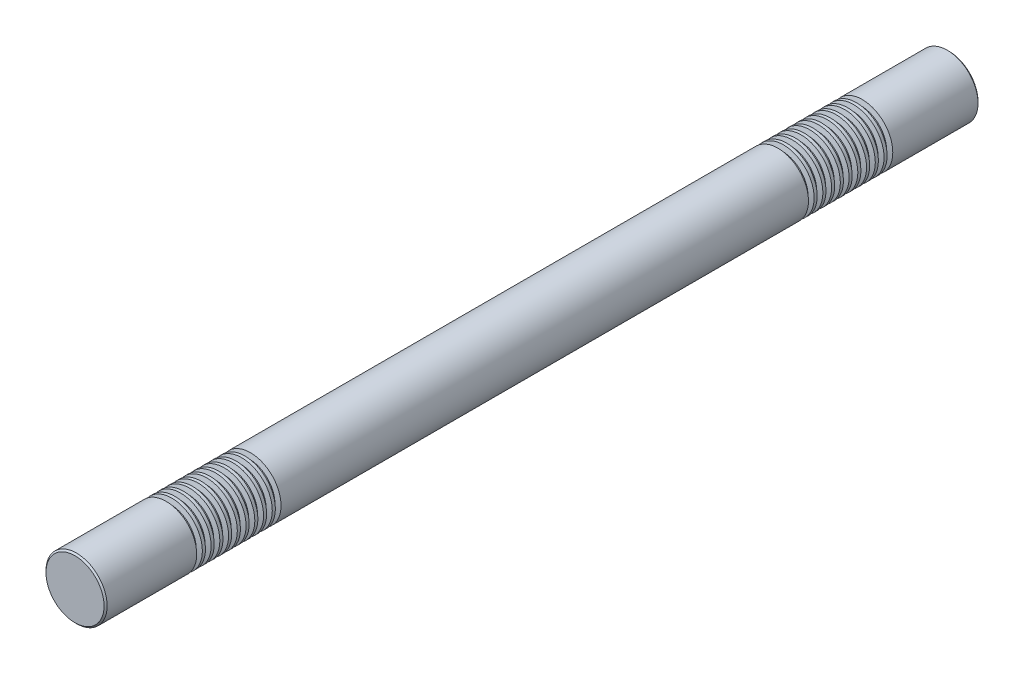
ISO-10303-21;
HEADER;
FILE_DESCRIPTION(('STEP AP214'),'2;1');
FILE_NAME('part.step','',(''),(''),'','','');
FILE_SCHEMA(('AUTOMOTIVE_DESIGN { 1 0 10303 214 1 1 1 1 }'));
ENDSEC;
DATA;
#1=APPLICATION_CONTEXT('core data for automotive mechanical design processes');
#2=APPLICATION_PROTOCOL_DEFINITION('international standard','automotive_design',2000,#1);
#3=PRODUCT_CONTEXT('',#1,'mechanical');
#4=PRODUCT('Part','Part','',(#3));
#5=PRODUCT_RELATED_PRODUCT_CATEGORY('part','',(#4));
#6=PRODUCT_DEFINITION_FORMATION('','',#4);
#7=PRODUCT_DEFINITION_CONTEXT('part definition',#1,'design');
#8=PRODUCT_DEFINITION('design','',#6,#7);
#9=PRODUCT_DEFINITION_SHAPE('','',#8);
#10=(LENGTH_UNIT() NAMED_UNIT(*) SI_UNIT(.MILLI.,.METRE.));
#11=(NAMED_UNIT(*) PLANE_ANGLE_UNIT() SI_UNIT($,.RADIAN.));
#12=(NAMED_UNIT(*) SI_UNIT($,.STERADIAN.) SOLID_ANGLE_UNIT());
#13=UNCERTAINTY_MEASURE_WITH_UNIT(LENGTH_MEASURE(1.E-05),#10,'distance_accuracy_value','');
#14=(GEOMETRIC_REPRESENTATION_CONTEXT(3) GLOBAL_UNCERTAINTY_ASSIGNED_CONTEXT((#13)) GLOBAL_UNIT_ASSIGNED_CONTEXT((#10,
#11,#12)) REPRESENTATION_CONTEXT('',''));
#15=CARTESIAN_POINT('',(0.,0.,0.));
#16=DIRECTION('',(0.,0.,1.));
#17=DIRECTION('',(1.,0.,0.));
#18=AXIS2_PLACEMENT_3D('',#15,#16,#17);
#19=CARTESIAN_POINT('',(0.,0.,500.));
#20=DIRECTION('',(0.,0.,-1.));
#21=DIRECTION('',(-1.,0.,0.));
#22=AXIS2_PLACEMENT_3D('',#19,#20,#21);
#23=CYLINDRICAL_SURFACE('',#22,35.);
#24=CARTESIAN_POINT('',(0.,0.,385.736860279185));
#25=DIRECTION('',(0.,0.,1.));
#26=DIRECTION('',(1.,0.,0.));
#27=AXIS2_PLACEMENT_3D('',#24,#25,#26);
#28=CIRCLE('',#27,35.);
#29=CARTESIAN_POINT('',(35.,0.,385.736860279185));
#30=VERTEX_POINT('',#29);
#31=EDGE_CURVE('E353',#30,#30,#28,.T.);
#32=ORIENTED_EDGE('',*,*,#31,.T.);
#33=EDGE_LOOP('',(#32));
#34=FACE_BOUND('',#33,.T.);
#35=CARTESIAN_POINT('',(0.,0.,389.263139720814));
#36=DIRECTION('',(0.,0.,1.));
#37=DIRECTION('',(1.,0.,0.));
#38=AXIS2_PLACEMENT_3D('',#35,#36,#37);
#39=CIRCLE('',#38,35.);
#40=CARTESIAN_POINT('',(35.,0.,389.263139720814));
#41=VERTEX_POINT('',#40);
#42=EDGE_CURVE('E365',#41,#41,#39,.T.);
#43=ORIENTED_EDGE('',*,*,#42,.F.);
#44=EDGE_LOOP('',(#43));
#45=FACE_BOUND('',#44,.T.);
#46=ADVANCED_FACE('F37',(#34,#45),#23,.T.);
#47=CARTESIAN_POINT('',(0.,0.,375.736860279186));
#48=DIRECTION('',(0.,0.,1.));
#49=DIRECTION('',(1.,0.,0.));
#50=AXIS2_PLACEMENT_3D('',#47,#48,#49);
#51=CIRCLE('',#50,35.);
#52=CARTESIAN_POINT('',(35.,0.,375.736860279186));
#53=VERTEX_POINT('',#52);
#54=EDGE_CURVE('E337',#53,#53,#51,.T.);
#55=ORIENTED_EDGE('',*,*,#54,.T.);
#56=EDGE_LOOP('',(#55));
#57=FACE_BOUND('',#56,.T.);
#58=CARTESIAN_POINT('',(0.,0.,379.263139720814));
#59=DIRECTION('',(0.,0.,1.));
#60=DIRECTION('',(1.,0.,0.));
#61=AXIS2_PLACEMENT_3D('',#58,#59,#60);
#62=CIRCLE('',#61,35.);
#63=CARTESIAN_POINT('',(35.,0.,379.263139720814));
#64=VERTEX_POINT('',#63);
#65=EDGE_CURVE('E349',#64,#64,#62,.T.);
#66=ORIENTED_EDGE('',*,*,#65,.F.);
#67=EDGE_LOOP('',(#66));
#68=FACE_BOUND('',#67,.T.);
#69=ADVANCED_FACE('F401',(#57,#68),#23,.T.);
#70=CARTESIAN_POINT('',(0.,0.,365.736860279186));
#71=DIRECTION('',(0.,0.,1.));
#72=DIRECTION('',(1.,0.,0.));
#73=AXIS2_PLACEMENT_3D('',#70,#71,#72);
#74=CIRCLE('',#73,35.);
#75=CARTESIAN_POINT('',(35.,0.,365.736860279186));
#76=VERTEX_POINT('',#75);
#77=EDGE_CURVE('E321',#76,#76,#74,.T.);
#78=ORIENTED_EDGE('',*,*,#77,.T.);
#79=EDGE_LOOP('',(#78));
#80=FACE_BOUND('',#79,.T.);
#81=CARTESIAN_POINT('',(0.,0.,369.263139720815));
#82=DIRECTION('',(0.,0.,1.));
#83=DIRECTION('',(1.,0.,0.));
#84=AXIS2_PLACEMENT_3D('',#81,#82,#83);
#85=CIRCLE('',#84,35.);
#86=CARTESIAN_POINT('',(35.,0.,369.263139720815));
#87=VERTEX_POINT('',#86);
#88=EDGE_CURVE('E333',#87,#87,#85,.T.);
#89=ORIENTED_EDGE('',*,*,#88,.F.);
#90=EDGE_LOOP('',(#89));
#91=FACE_BOUND('',#90,.T.);
#92=ADVANCED_FACE('F409',(#80,#91),#23,.T.);
#93=CARTESIAN_POINT('',(0.,0.,355.736860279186));
#94=DIRECTION('',(0.,0.,1.));
#95=DIRECTION('',(1.,0.,0.));
#96=AXIS2_PLACEMENT_3D('',#93,#94,#95);
#97=CIRCLE('',#96,35.);
#98=CARTESIAN_POINT('',(35.,0.,355.736860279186));
#99=VERTEX_POINT('',#98);
#100=EDGE_CURVE('E305',#99,#99,#97,.T.);
#101=ORIENTED_EDGE('',*,*,#100,.T.);
#102=EDGE_LOOP('',(#101));
#103=FACE_BOUND('',#102,.T.);
#104=CARTESIAN_POINT('',(0.,0.,359.263139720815));
#105=DIRECTION('',(0.,0.,1.));
#106=DIRECTION('',(1.,0.,0.));
#107=AXIS2_PLACEMENT_3D('',#104,#105,#106);
#108=CIRCLE('',#107,35.);
#109=CARTESIAN_POINT('',(35.,0.,359.263139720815));
#110=VERTEX_POINT('',#109);
#111=EDGE_CURVE('E317',#110,#110,#108,.T.);
#112=ORIENTED_EDGE('',*,*,#111,.F.);
#113=EDGE_LOOP('',(#112));
#114=FACE_BOUND('',#113,.T.);
#115=ADVANCED_FACE('F770',(#103,#114),#23,.T.);
#116=CARTESIAN_POINT('',(0.,0.,345.736860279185));
#117=DIRECTION('',(0.,0.,1.));
#118=DIRECTION('',(1.,0.,0.));
#119=AXIS2_PLACEMENT_3D('',#116,#117,#118);
#120=CIRCLE('',#119,35.);
#121=CARTESIAN_POINT('',(35.,0.,345.736860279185));
#122=VERTEX_POINT('',#121);
#123=EDGE_CURVE('E289',#122,#122,#120,.T.);
#124=ORIENTED_EDGE('',*,*,#123,.T.);
#125=EDGE_LOOP('',(#124));
#126=FACE_BOUND('',#125,.T.);
#127=CARTESIAN_POINT('',(0.,0.,349.263139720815));
#128=DIRECTION('',(0.,0.,1.));
#129=DIRECTION('',(1.,0.,0.));
#130=AXIS2_PLACEMENT_3D('',#127,#128,#129);
#131=CIRCLE('',#130,35.);
#132=CARTESIAN_POINT('',(35.,0.,349.263139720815));
#133=VERTEX_POINT('',#132);
#134=EDGE_CURVE('E301',#133,#133,#131,.T.);
#135=ORIENTED_EDGE('',*,*,#134,.F.);
#136=EDGE_LOOP('',(#135));
#137=FACE_BOUND('',#136,.T.);
#138=ADVANCED_FACE('F747',(#126,#137),#23,.T.);
#139=CARTESIAN_POINT('',(0.,0.,335.736860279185));
#140=DIRECTION('',(0.,0.,1.));
#141=DIRECTION('',(1.,0.,0.));
#142=AXIS2_PLACEMENT_3D('',#139,#140,#141);
#143=CIRCLE('',#142,35.);
#144=CARTESIAN_POINT('',(35.,0.,335.736860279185));
#145=VERTEX_POINT('',#144);
#146=EDGE_CURVE('E273',#145,#145,#143,.T.);
#147=ORIENTED_EDGE('',*,*,#146,.T.);
#148=EDGE_LOOP('',(#147));
#149=FACE_BOUND('',#148,.T.);
#150=CARTESIAN_POINT('',(0.,0.,339.263139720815));
#151=DIRECTION('',(0.,0.,1.));
#152=DIRECTION('',(1.,0.,0.));
#153=AXIS2_PLACEMENT_3D('',#150,#151,#152);
#154=CIRCLE('',#153,35.);
#155=CARTESIAN_POINT('',(35.,0.,339.263139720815));
#156=VERTEX_POINT('',#155);
#157=EDGE_CURVE('E285',#156,#156,#154,.T.);
#158=ORIENTED_EDGE('',*,*,#157,.F.);
#159=EDGE_LOOP('',(#158));
#160=FACE_BOUND('',#159,.T.);
#161=ADVANCED_FACE('F724',(#149,#160),#23,.T.);
#162=CARTESIAN_POINT('',(0.,0.,325.736860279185));
#163=DIRECTION('',(0.,0.,1.));
#164=DIRECTION('',(1.,0.,0.));
#165=AXIS2_PLACEMENT_3D('',#162,#163,#164);
#166=CIRCLE('',#165,35.);
#167=CARTESIAN_POINT('',(35.,0.,325.736860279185));
#168=VERTEX_POINT('',#167);
#169=EDGE_CURVE('E257',#168,#168,#166,.T.);
#170=ORIENTED_EDGE('',*,*,#169,.T.);
#171=EDGE_LOOP('',(#170));
#172=FACE_BOUND('',#171,.T.);
#173=CARTESIAN_POINT('',(0.,0.,329.263139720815));
#174=DIRECTION('',(0.,0.,1.));
#175=DIRECTION('',(1.,0.,0.));
#176=AXIS2_PLACEMENT_3D('',#173,#174,#175);
#177=CIRCLE('',#176,35.);
#178=CARTESIAN_POINT('',(35.,0.,329.263139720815));
#179=VERTEX_POINT('',#178);
#180=EDGE_CURVE('E269',#179,#179,#177,.T.);
#181=ORIENTED_EDGE('',*,*,#180,.F.);
#182=EDGE_LOOP('',(#181));
#183=FACE_BOUND('',#182,.T.);
#184=ADVANCED_FACE('F701',(#172,#183),#23,.T.);
#185=CARTESIAN_POINT('',(0.,0.,315.736860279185));
#186=DIRECTION('',(0.,0.,1.));
#187=DIRECTION('',(1.,0.,0.));
#188=AXIS2_PLACEMENT_3D('',#185,#186,#187);
#189=CIRCLE('',#188,35.);
#190=CARTESIAN_POINT('',(35.,0.,315.736860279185));
#191=VERTEX_POINT('',#190);
#192=EDGE_CURVE('E241',#191,#191,#189,.T.);
#193=ORIENTED_EDGE('',*,*,#192,.T.);
#194=EDGE_LOOP('',(#193));
#195=FACE_BOUND('',#194,.T.);
#196=CARTESIAN_POINT('',(0.,0.,319.263139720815));
#197=DIRECTION('',(0.,0.,1.));
#198=DIRECTION('',(1.,0.,0.));
#199=AXIS2_PLACEMENT_3D('',#196,#197,#198);
#200=CIRCLE('',#199,35.);
#201=CARTESIAN_POINT('',(35.,0.,319.263139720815));
#202=VERTEX_POINT('',#201);
#203=EDGE_CURVE('E253',#202,#202,#200,.T.);
#204=ORIENTED_EDGE('',*,*,#203,.F.);
#205=EDGE_LOOP('',(#204));
#206=FACE_BOUND('',#205,.T.);
#207=ADVANCED_FACE('F678',(#195,#206),#23,.T.);
#208=CARTESIAN_POINT('',(0.,0.,305.736860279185));
#209=DIRECTION('',(0.,0.,1.));
#210=DIRECTION('',(1.,0.,0.));
#211=AXIS2_PLACEMENT_3D('',#208,#209,#210);
#212=CIRCLE('',#211,35.);
#213=CARTESIAN_POINT('',(35.,0.,305.736860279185));
#214=VERTEX_POINT('',#213);
#215=EDGE_CURVE('E225',#214,#214,#212,.T.);
#216=ORIENTED_EDGE('',*,*,#215,.T.);
#217=EDGE_LOOP('',(#216));
#218=FACE_BOUND('',#217,.T.);
#219=CARTESIAN_POINT('',(0.,0.,309.263139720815));
#220=DIRECTION('',(0.,0.,1.));
#221=DIRECTION('',(1.,0.,0.));
#222=AXIS2_PLACEMENT_3D('',#219,#220,#221);
#223=CIRCLE('',#222,35.);
#224=CARTESIAN_POINT('',(35.,0.,309.263139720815));
#225=VERTEX_POINT('',#224);
#226=EDGE_CURVE('E237',#225,#225,#223,.T.);
#227=ORIENTED_EDGE('',*,*,#226,.F.);
#228=EDGE_LOOP('',(#227));
#229=FACE_BOUND('',#228,.T.);
#230=ADVANCED_FACE('F655',(#218,#229),#23,.T.);
#231=CARTESIAN_POINT('',(0.,0.,-304.263139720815));
#232=DIRECTION('',(0.,0.,1.));
#233=DIRECTION('',(1.,0.,0.));
#234=AXIS2_PLACEMENT_3D('',#231,#232,#233);
#235=CIRCLE('',#234,35.);
#236=CARTESIAN_POINT('',(35.,0.,-304.263139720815));
#237=VERTEX_POINT('',#236);
#238=EDGE_CURVE('E209',#237,#237,#235,.T.);
#239=ORIENTED_EDGE('',*,*,#238,.T.);
#240=EDGE_LOOP('',(#239));
#241=FACE_BOUND('',#240,.T.);
#242=CARTESIAN_POINT('',(0.,0.,299.263139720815));
#243=DIRECTION('',(0.,0.,1.));
#244=DIRECTION('',(1.,0.,0.));
#245=AXIS2_PLACEMENT_3D('',#242,#243,#244);
#246=CIRCLE('',#245,35.);
#247=CARTESIAN_POINT('',(35.,0.,299.263139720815));
#248=VERTEX_POINT('',#247);
#249=EDGE_CURVE('E221',#248,#248,#246,.T.);
#250=ORIENTED_EDGE('',*,*,#249,.F.);
#251=EDGE_LOOP('',(#250));
#252=FACE_BOUND('',#251,.T.);
#253=ADVANCED_FACE('F632',(#241,#252),#23,.T.);
#254=CARTESIAN_POINT('',(0.,0.,-314.263139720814));
#255=DIRECTION('',(0.,0.,1.));
#256=DIRECTION('',(1.,0.,0.));
#257=AXIS2_PLACEMENT_3D('',#254,#255,#256);
#258=CIRCLE('',#257,35.);
#259=CARTESIAN_POINT('',(35.,0.,-314.263139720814));
#260=VERTEX_POINT('',#259);
#261=EDGE_CURVE('E193',#260,#260,#258,.T.);
#262=ORIENTED_EDGE('',*,*,#261,.T.);
#263=EDGE_LOOP('',(#262));
#264=FACE_BOUND('',#263,.T.);
#265=CARTESIAN_POINT('',(0.,0.,-310.736860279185));
#266=DIRECTION('',(0.,0.,1.));
#267=DIRECTION('',(1.,0.,0.));
#268=AXIS2_PLACEMENT_3D('',#265,#266,#267);
#269=CIRCLE('',#268,35.);
#270=CARTESIAN_POINT('',(35.,0.,-310.736860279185));
#271=VERTEX_POINT('',#270);
#272=EDGE_CURVE('E205',#271,#271,#269,.T.);
#273=ORIENTED_EDGE('',*,*,#272,.F.);
#274=EDGE_LOOP('',(#273));
#275=FACE_BOUND('',#274,.T.);
#276=ADVANCED_FACE('F609',(#264,#275),#23,.T.);
#277=CARTESIAN_POINT('',(0.,0.,-324.263139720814));
#278=DIRECTION('',(0.,0.,1.));
#279=DIRECTION('',(1.,0.,0.));
#280=AXIS2_PLACEMENT_3D('',#277,#278,#279);
#281=CIRCLE('',#280,35.);
#282=CARTESIAN_POINT('',(35.,0.,-324.263139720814));
#283=VERTEX_POINT('',#282);
#284=EDGE_CURVE('E177',#283,#283,#281,.T.);
#285=ORIENTED_EDGE('',*,*,#284,.T.);
#286=EDGE_LOOP('',(#285));
#287=FACE_BOUND('',#286,.T.);
#288=CARTESIAN_POINT('',(0.,0.,-320.736860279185));
#289=DIRECTION('',(0.,0.,1.));
#290=DIRECTION('',(1.,0.,0.));
#291=AXIS2_PLACEMENT_3D('',#288,#289,#290);
#292=CIRCLE('',#291,35.);
#293=CARTESIAN_POINT('',(35.,0.,-320.736860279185));
#294=VERTEX_POINT('',#293);
#295=EDGE_CURVE('E189',#294,#294,#292,.T.);
#296=ORIENTED_EDGE('',*,*,#295,.F.);
#297=EDGE_LOOP('',(#296));
#298=FACE_BOUND('',#297,.T.);
#299=ADVANCED_FACE('F586',(#287,#298),#23,.T.);
#300=CARTESIAN_POINT('',(0.,0.,-334.263139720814));
#301=DIRECTION('',(0.,0.,1.));
#302=DIRECTION('',(1.,0.,0.));
#303=AXIS2_PLACEMENT_3D('',#300,#301,#302);
#304=CIRCLE('',#303,35.);
#305=CARTESIAN_POINT('',(35.,0.,-334.263139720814));
#306=VERTEX_POINT('',#305);
#307=EDGE_CURVE('E163',#306,#306,#304,.T.);
#308=ORIENTED_EDGE('',*,*,#307,.T.);
#309=EDGE_LOOP('',(#308));
#310=FACE_BOUND('',#309,.T.);
#311=CARTESIAN_POINT('',(0.,0.,-330.736860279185));
#312=DIRECTION('',(0.,0.,1.));
#313=DIRECTION('',(1.,0.,0.));
#314=AXIS2_PLACEMENT_3D('',#311,#312,#313);
#315=CIRCLE('',#314,35.);
#316=CARTESIAN_POINT('',(35.,0.,-330.736860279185));
#317=VERTEX_POINT('',#316);
#318=EDGE_CURVE('E174',#317,#317,#315,.T.);
#319=ORIENTED_EDGE('',*,*,#318,.F.);
#320=EDGE_LOOP('',(#319));
#321=FACE_BOUND('',#320,.T.);
#322=ADVANCED_FACE('F563',(#310,#321),#23,.T.);
#323=CARTESIAN_POINT('',(0.,0.,-344.263139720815));
#324=DIRECTION('',(0.,0.,1.));
#325=DIRECTION('',(1.,0.,0.));
#326=AXIS2_PLACEMENT_3D('',#323,#324,#325);
#327=CIRCLE('',#326,35.);
#328=CARTESIAN_POINT('',(35.,0.,-344.263139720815));
#329=VERTEX_POINT('',#328);
#330=EDGE_CURVE('E147',#329,#329,#327,.T.);
#331=ORIENTED_EDGE('',*,*,#330,.T.);
#332=EDGE_LOOP('',(#331));
#333=FACE_BOUND('',#332,.T.);
#334=CARTESIAN_POINT('',(0.,0.,-340.736860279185));
#335=DIRECTION('',(0.,0.,1.));
#336=DIRECTION('',(1.,0.,0.));
#337=AXIS2_PLACEMENT_3D('',#334,#335,#336);
#338=CIRCLE('',#337,35.);
#339=CARTESIAN_POINT('',(35.,0.,-340.736860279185));
#340=VERTEX_POINT('',#339);
#341=EDGE_CURVE('E159',#340,#340,#338,.T.);
#342=ORIENTED_EDGE('',*,*,#341,.F.);
#343=EDGE_LOOP('',(#342));
#344=FACE_BOUND('',#343,.T.);
#345=ADVANCED_FACE('F540',(#333,#344),#23,.T.);
#346=CARTESIAN_POINT('',(0.,0.,-354.263139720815));
#347=DIRECTION('',(0.,0.,1.));
#348=DIRECTION('',(1.,0.,0.));
#349=AXIS2_PLACEMENT_3D('',#346,#347,#348);
#350=CIRCLE('',#349,35.);
#351=CARTESIAN_POINT('',(35.,0.,-354.263139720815));
#352=VERTEX_POINT('',#351);
#353=EDGE_CURVE('E131',#352,#352,#350,.T.);
#354=ORIENTED_EDGE('',*,*,#353,.T.);
#355=EDGE_LOOP('',(#354));
#356=FACE_BOUND('',#355,.T.);
#357=CARTESIAN_POINT('',(0.,0.,-350.736860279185));
#358=DIRECTION('',(0.,0.,1.));
#359=DIRECTION('',(1.,0.,0.));
#360=AXIS2_PLACEMENT_3D('',#357,#358,#359);
#361=CIRCLE('',#360,35.);
#362=CARTESIAN_POINT('',(35.,0.,-350.736860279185));
#363=VERTEX_POINT('',#362);
#364=EDGE_CURVE('E143',#363,#363,#361,.T.);
#365=ORIENTED_EDGE('',*,*,#364,.F.);
#366=EDGE_LOOP('',(#365));
#367=FACE_BOUND('',#366,.T.);
#368=ADVANCED_FACE('F517',(#356,#367),#23,.T.);
#369=CARTESIAN_POINT('',(0.,0.,-364.263139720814));
#370=DIRECTION('',(0.,0.,1.));
#371=DIRECTION('',(1.,0.,0.));
#372=AXIS2_PLACEMENT_3D('',#369,#370,#371);
#373=CIRCLE('',#372,35.);
#374=CARTESIAN_POINT('',(35.,0.,-364.263139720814));
#375=VERTEX_POINT('',#374);
#376=EDGE_CURVE('E115',#375,#375,#373,.T.);
#377=ORIENTED_EDGE('',*,*,#376,.T.);
#378=EDGE_LOOP('',(#377));
#379=FACE_BOUND('',#378,.T.);
#380=CARTESIAN_POINT('',(0.,0.,-360.736860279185));
#381=DIRECTION('',(0.,0.,1.));
#382=DIRECTION('',(1.,0.,0.));
#383=AXIS2_PLACEMENT_3D('',#380,#381,#382);
#384=CIRCLE('',#383,35.);
#385=CARTESIAN_POINT('',(35.,0.,-360.736860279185));
#386=VERTEX_POINT('',#385);
#387=EDGE_CURVE('E127',#386,#386,#384,.T.);
#388=ORIENTED_EDGE('',*,*,#387,.F.);
#389=EDGE_LOOP('',(#388));
#390=FACE_BOUND('',#389,.T.);
#391=ADVANCED_FACE('F494',(#379,#390),#23,.T.);
#392=CARTESIAN_POINT('',(0.,0.,-374.263139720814));
#393=DIRECTION('',(0.,0.,1.));
#394=DIRECTION('',(1.,0.,0.));
#395=AXIS2_PLACEMENT_3D('',#392,#393,#394);
#396=CIRCLE('',#395,35.);
#397=CARTESIAN_POINT('',(35.,0.,-374.263139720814));
#398=VERTEX_POINT('',#397);
#399=EDGE_CURVE('E99',#398,#398,#396,.T.);
#400=ORIENTED_EDGE('',*,*,#399,.T.);
#401=EDGE_LOOP('',(#400));
#402=FACE_BOUND('',#401,.T.);
#403=CARTESIAN_POINT('',(0.,0.,-370.736860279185));
#404=DIRECTION('',(0.,0.,1.));
#405=DIRECTION('',(1.,0.,0.));
#406=AXIS2_PLACEMENT_3D('',#403,#404,#405);
#407=CIRCLE('',#406,35.);
#408=CARTESIAN_POINT('',(35.,0.,-370.736860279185));
#409=VERTEX_POINT('',#408);
#410=EDGE_CURVE('E111',#409,#409,#407,.T.);
#411=ORIENTED_EDGE('',*,*,#410,.F.);
#412=EDGE_LOOP('',(#411));
#413=FACE_BOUND('',#412,.T.);
#414=ADVANCED_FACE('F471',(#402,#413),#23,.T.);
#415=CARTESIAN_POINT('',(0.,0.,-384.263139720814));
#416=DIRECTION('',(0.,0.,1.));
#417=DIRECTION('',(1.,0.,0.));
#418=AXIS2_PLACEMENT_3D('',#415,#416,#417);
#419=CIRCLE('',#418,35.);
#420=CARTESIAN_POINT('',(35.,0.,-384.263139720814));
#421=VERTEX_POINT('',#420);
#422=EDGE_CURVE('E85',#421,#421,#419,.T.);
#423=ORIENTED_EDGE('',*,*,#422,.T.);
#424=EDGE_LOOP('',(#423));
#425=FACE_BOUND('',#424,.T.);
#426=CARTESIAN_POINT('',(0.,0.,-380.736860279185));
#427=DIRECTION('',(0.,0.,1.));
#428=DIRECTION('',(1.,0.,0.));
#429=AXIS2_PLACEMENT_3D('',#426,#427,#428);
#430=CIRCLE('',#429,35.);
#431=CARTESIAN_POINT('',(35.,0.,-380.736860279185));
#432=VERTEX_POINT('',#431);
#433=EDGE_CURVE('E95',#432,#432,#430,.T.);
#434=ORIENTED_EDGE('',*,*,#433,.F.);
#435=EDGE_LOOP('',(#434));
#436=FACE_BOUND('',#435,.T.);
#437=ADVANCED_FACE('F424',(#425,#436),#23,.T.);
#438=CARTESIAN_POINT('',(0.,0.,-394.263139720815));
#439=DIRECTION('',(0.,0.,1.));
#440=DIRECTION('',(1.,0.,0.));
#441=AXIS2_PLACEMENT_3D('',#438,#439,#440);
#442=CIRCLE('',#441,35.);
#443=CARTESIAN_POINT('',(35.,0.,-394.263139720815));
#444=VERTEX_POINT('',#443);
#445=EDGE_CURVE('E69',#444,#444,#442,.T.);
#446=ORIENTED_EDGE('',*,*,#445,.T.);
#447=EDGE_LOOP('',(#446));
#448=FACE_BOUND('',#447,.T.);
#449=CARTESIAN_POINT('',(0.,0.,-390.736860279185));
#450=DIRECTION('',(0.,0.,1.));
#451=DIRECTION('',(1.,0.,0.));
#452=AXIS2_PLACEMENT_3D('',#449,#450,#451);
#453=CIRCLE('',#452,35.);
#454=CARTESIAN_POINT('',(35.,0.,-390.736860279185));
#455=VERTEX_POINT('',#454);
#456=EDGE_CURVE('E81',#455,#455,#453,.T.);
#457=ORIENTED_EDGE('',*,*,#456,.F.);
#458=EDGE_LOOP('',(#457));
#459=FACE_BOUND('',#458,.T.);
#460=ADVANCED_FACE('F417',(#448,#459),#23,.T.);
#461=CARTESIAN_POINT('',(0.,0.,-498.25));
#462=DIRECTION('',(0.,0.,1.));
#463=DIRECTION('',(1.,0.,0.));
#464=AXIS2_PLACEMENT_3D('',#461,#462,#463);
#465=CIRCLE('',#464,35.);
#466=CARTESIAN_POINT('',(35.,0.,-498.25));
#467=VERTEX_POINT('',#466);
#468=EDGE_CURVE('E52',#467,#467,#465,.T.);
#469=ORIENTED_EDGE('',*,*,#468,.T.);
#470=EDGE_LOOP('',(#469));
#471=FACE_BOUND('',#470,.T.);
#472=CARTESIAN_POINT('',(0.,0.,-400.736860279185));
#473=DIRECTION('',(0.,0.,1.));
#474=DIRECTION('',(1.,0.,0.));
#475=AXIS2_PLACEMENT_3D('',#472,#473,#474);
#476=CIRCLE('',#475,35.);
#477=CARTESIAN_POINT('',(35.,0.,-400.736860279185));
#478=VERTEX_POINT('',#477);
#479=EDGE_CURVE('E65',#478,#478,#476,.T.);
#480=ORIENTED_EDGE('',*,*,#479,.F.);
#481=EDGE_LOOP('',(#480));
#482=FACE_BOUND('',#481,.T.);
#483=ADVANCED_FACE('F405',(#471,#482),#23,.T.);
#484=CARTESIAN_POINT('',(0.,0.,-500.));
#485=DIRECTION('',(0.,0.,1.));
#486=DIRECTION('',(1.,0.,0.));
#487=AXIS2_PLACEMENT_3D('',#484,#485,#486);
#488=PLANE('',#487);
#489=CARTESIAN_POINT('',(0.,0.,-500.));
#490=DIRECTION('',(0.,0.,1.));
#491=DIRECTION('',(1.,0.,0.));
#492=AXIS2_PLACEMENT_3D('',#489,#490,#491);
#493=CIRCLE('',#492,33.2499999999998);
#494=CARTESIAN_POINT('',(33.2499999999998,0.,-500.));
#495=VERTEX_POINT('',#494);
#496=EDGE_CURVE('E45',#495,#495,#493,.F.);
#497=ORIENTED_EDGE('',*,*,#496,.T.);
#498=EDGE_LOOP('',(#497));
#499=FACE_BOUND('',#498,.T.);
#500=ADVANCED_FACE('F416',(#499),#488,.F.);
#501=CARTESIAN_POINT('',(0.,0.,-498.25));
#502=DIRECTION('',(0.,0.,1.));
#503=DIRECTION('',(1.,0.,0.));
#504=AXIS2_PLACEMENT_3D('',#501,#502,#503);
#505=CONICAL_SURFACE('',#504,35.,0.785398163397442);
#506=ORIENTED_EDGE('',*,*,#496,.F.);
#507=EDGE_LOOP('',(#506));
#508=FACE_BOUND('',#507,.T.);
#509=ORIENTED_EDGE('',*,*,#468,.F.);
#510=EDGE_LOOP('',(#509));
#511=FACE_BOUND('',#510,.T.);
#512=ADVANCED_FACE('F423',(#508,#511),#505,.T.);
#513=CARTESIAN_POINT('',(0.,0.,-399.263139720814));
#514=DIRECTION('',(0.,0.,-1.));
#515=DIRECTION('',(-1.,0.,0.));
#516=AXIS2_PLACEMENT_3D('',#513,#514,#515);
#517=CONICAL_SURFACE('',#516,29.5,1.30899693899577);
#518=ORIENTED_EDGE('',*,*,#479,.T.);
#519=EDGE_LOOP('',(#518));
#520=FACE_BOUND('',#519,.T.);
#521=CARTESIAN_POINT('',(0.,0.,-399.263139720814));
#522=DIRECTION('',(0.,0.,1.));
#523=DIRECTION('',(1.,0.,0.));
#524=AXIS2_PLACEMENT_3D('',#521,#522,#523);
#525=CIRCLE('',#524,29.5);
#526=CARTESIAN_POINT('',(29.5,0.,-399.263139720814));
#527=VERTEX_POINT('',#526);
#528=EDGE_CURVE('E77',#527,#527,#525,.T.);
#529=ORIENTED_EDGE('',*,*,#528,.F.);
#530=EDGE_LOOP('',(#529));
#531=FACE_BOUND('',#530,.T.);
#532=ADVANCED_FACE('F430',(#520,#531),#517,.T.);
#533=CARTESIAN_POINT('',(0.,0.,-394.263139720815));
#534=DIRECTION('',(0.,0.,1.));
#535=DIRECTION('',(1.,0.,0.));
#536=AXIS2_PLACEMENT_3D('',#533,#534,#535);
#537=CONICAL_SURFACE('',#536,35.,1.30899693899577);
#538=CARTESIAN_POINT('',(0.,0.,-395.736860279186));
#539=DIRECTION('',(0.,0.,1.));
#540=DIRECTION('',(1.,0.,0.));
#541=AXIS2_PLACEMENT_3D('',#538,#539,#540);
#542=CIRCLE('',#541,29.5);
#543=CARTESIAN_POINT('',(29.5,0.,-395.736860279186));
#544=VERTEX_POINT('',#543);
#545=EDGE_CURVE('E73',#544,#544,#542,.T.);
#546=ORIENTED_EDGE('',*,*,#545,.T.);
#547=EDGE_LOOP('',(#546));
#548=FACE_BOUND('',#547,.T.);
#549=ORIENTED_EDGE('',*,*,#445,.F.);
#550=EDGE_LOOP('',(#549));
#551=FACE_BOUND('',#550,.T.);
#552=ADVANCED_FACE('F433',(#548,#551),#537,.T.);
#553=CARTESIAN_POINT('',(0.,0.,498.25));
#554=DIRECTION('',(0.,0.,1.));
#555=DIRECTION('',(1.,0.,0.));
#556=AXIS2_PLACEMENT_3D('',#553,#554,#555);
#557=CYLINDRICAL_SURFACE('',#556,29.5);
#558=ORIENTED_EDGE('',*,*,#528,.T.);
#559=EDGE_LOOP('',(#558));
#560=FACE_BOUND('',#559,.T.);
#561=ORIENTED_EDGE('',*,*,#545,.F.);
#562=EDGE_LOOP('',(#561));
#563=FACE_BOUND('',#562,.T.);
#564=ADVANCED_FACE('F437',(#560,#563),#557,.T.);
#565=CARTESIAN_POINT('',(0.,0.,-389.263139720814));
#566=DIRECTION('',(0.,0.,-1.));
#567=DIRECTION('',(-1.,0.,0.));
#568=AXIS2_PLACEMENT_3D('',#565,#566,#567);
#569=CONICAL_SURFACE('',#568,29.5,1.30899693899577);
#570=ORIENTED_EDGE('',*,*,#456,.T.);
#571=EDGE_LOOP('',(#570));
#572=FACE_BOUND('',#571,.T.);
#573=CARTESIAN_POINT('',(0.,0.,-389.263139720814));
#574=DIRECTION('',(0.,0.,1.));
#575=DIRECTION('',(1.,0.,0.));
#576=AXIS2_PLACEMENT_3D('',#573,#574,#575);
#577=CIRCLE('',#576,29.5);
#578=CARTESIAN_POINT('',(29.5,0.,-389.263139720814));
#579=VERTEX_POINT('',#578);
#580=EDGE_CURVE('E91',#579,#579,#577,.T.);
#581=ORIENTED_EDGE('',*,*,#580,.F.);
#582=EDGE_LOOP('',(#581));
#583=FACE_BOUND('',#582,.T.);
#584=ADVANCED_FACE('F440',(#572,#583),#569,.T.);
#585=CARTESIAN_POINT('',(0.,0.,-384.263139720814));
#586=DIRECTION('',(0.,0.,1.));
#587=DIRECTION('',(1.,0.,0.));
#588=AXIS2_PLACEMENT_3D('',#585,#586,#587);
#589=CONICAL_SURFACE('',#588,35.,1.30899693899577);
#590=CARTESIAN_POINT('',(0.,0.,-385.736860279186));
#591=DIRECTION('',(0.,0.,1.));
#592=DIRECTION('',(1.,0.,0.));
#593=AXIS2_PLACEMENT_3D('',#590,#591,#592);
#594=CIRCLE('',#593,29.5);
#595=CARTESIAN_POINT('',(29.5,0.,-385.736860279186));
#596=VERTEX_POINT('',#595);
#597=EDGE_CURVE('E88',#596,#596,#594,.T.);
#598=ORIENTED_EDGE('',*,*,#597,.T.);
#599=EDGE_LOOP('',(#598));
#600=FACE_BOUND('',#599,.T.);
#601=ORIENTED_EDGE('',*,*,#422,.F.);
#602=EDGE_LOOP('',(#601));
#603=FACE_BOUND('',#602,.T.);
#604=ADVANCED_FACE('F453',(#600,#603),#589,.T.);
#605=CARTESIAN_POINT('',(0.,0.,-390.736860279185));
#606=DIRECTION('',(0.,0.,1.));
#607=DIRECTION('',(1.,0.,0.));
#608=AXIS2_PLACEMENT_3D('',#605,#606,#607);
#609=CYLINDRICAL_SURFACE('',#608,29.5);
#610=ORIENTED_EDGE('',*,*,#580,.T.);
#611=EDGE_LOOP('',(#610));
#612=FACE_BOUND('',#611,.T.);
#613=ORIENTED_EDGE('',*,*,#597,.F.);
#614=EDGE_LOOP('',(#613));
#615=FACE_BOUND('',#614,.T.);
#616=ADVANCED_FACE('F457',(#612,#615),#609,.T.);
#617=CARTESIAN_POINT('',(0.,0.,-379.263139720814));
#618=DIRECTION('',(0.,0.,-1.));
#619=DIRECTION('',(-1.,0.,0.));
#620=AXIS2_PLACEMENT_3D('',#617,#618,#619);
#621=CONICAL_SURFACE('',#620,29.5,1.30899693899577);
#622=ORIENTED_EDGE('',*,*,#433,.T.);
#623=EDGE_LOOP('',(#622));
#624=FACE_BOUND('',#623,.T.);
#625=CARTESIAN_POINT('',(0.,0.,-379.263139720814));
#626=DIRECTION('',(0.,0.,1.));
#627=DIRECTION('',(1.,0.,0.));
#628=AXIS2_PLACEMENT_3D('',#625,#626,#627);
#629=CIRCLE('',#628,29.5);
#630=CARTESIAN_POINT('',(29.5,0.,-379.263139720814));
#631=VERTEX_POINT('',#630);
#632=EDGE_CURVE('E107',#631,#631,#629,.T.);
#633=ORIENTED_EDGE('',*,*,#632,.F.);
#634=EDGE_LOOP('',(#633));
#635=FACE_BOUND('',#634,.T.);
#636=ADVANCED_FACE('F460',(#624,#635),#621,.T.);
#637=CARTESIAN_POINT('',(0.,0.,-374.263139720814));
#638=DIRECTION('',(0.,0.,1.));
#639=DIRECTION('',(1.,0.,0.));
#640=AXIS2_PLACEMENT_3D('',#637,#638,#639);
#641=CONICAL_SURFACE('',#640,35.,1.30899693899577);
#642=CARTESIAN_POINT('',(0.,0.,-375.736860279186));
#643=DIRECTION('',(0.,0.,1.));
#644=DIRECTION('',(1.,0.,0.));
#645=AXIS2_PLACEMENT_3D('',#642,#643,#644);
#646=CIRCLE('',#645,29.5);
#647=CARTESIAN_POINT('',(29.5,0.,-375.736860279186));
#648=VERTEX_POINT('',#647);
#649=EDGE_CURVE('E103',#648,#648,#646,.T.);
#650=ORIENTED_EDGE('',*,*,#649,.T.);
#651=EDGE_LOOP('',(#650));
#652=FACE_BOUND('',#651,.T.);
#653=ORIENTED_EDGE('',*,*,#399,.F.);
#654=EDGE_LOOP('',(#653));
#655=FACE_BOUND('',#654,.T.);
#656=ADVANCED_FACE('F476',(#652,#655),#641,.T.);
#657=CARTESIAN_POINT('',(0.,0.,-380.736860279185));
#658=DIRECTION('',(0.,0.,1.));
#659=DIRECTION('',(1.,0.,0.));
#660=AXIS2_PLACEMENT_3D('',#657,#658,#659);
#661=CYLINDRICAL_SURFACE('',#660,29.5);
#662=ORIENTED_EDGE('',*,*,#632,.T.);
#663=EDGE_LOOP('',(#662));
#664=FACE_BOUND('',#663,.T.);
#665=ORIENTED_EDGE('',*,*,#649,.F.);
#666=EDGE_LOOP('',(#665));
#667=FACE_BOUND('',#666,.T.);
#668=ADVANCED_FACE('F480',(#664,#667),#661,.T.);
#669=CARTESIAN_POINT('',(0.,0.,-369.263139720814));
#670=DIRECTION('',(0.,0.,-1.));
#671=DIRECTION('',(-1.,0.,0.));
#672=AXIS2_PLACEMENT_3D('',#669,#670,#671);
#673=CONICAL_SURFACE('',#672,29.5,1.30899693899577);
#674=ORIENTED_EDGE('',*,*,#410,.T.);
#675=EDGE_LOOP('',(#674));
#676=FACE_BOUND('',#675,.T.);
#677=CARTESIAN_POINT('',(0.,0.,-369.263139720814));
#678=DIRECTION('',(0.,0.,1.));
#679=DIRECTION('',(1.,0.,0.));
#680=AXIS2_PLACEMENT_3D('',#677,#678,#679);
#681=CIRCLE('',#680,29.5);
#682=CARTESIAN_POINT('',(29.5,0.,-369.263139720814));
#683=VERTEX_POINT('',#682);
#684=EDGE_CURVE('E123',#683,#683,#681,.T.);
#685=ORIENTED_EDGE('',*,*,#684,.F.);
#686=EDGE_LOOP('',(#685));
#687=FACE_BOUND('',#686,.T.);
#688=ADVANCED_FACE('F483',(#676,#687),#673,.T.);
#689=CARTESIAN_POINT('',(0.,0.,-364.263139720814));
#690=DIRECTION('',(0.,0.,1.));
#691=DIRECTION('',(1.,0.,0.));
#692=AXIS2_PLACEMENT_3D('',#689,#690,#691);
#693=CONICAL_SURFACE('',#692,35.,1.30899693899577);
#694=CARTESIAN_POINT('',(0.,0.,-365.736860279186));
#695=DIRECTION('',(0.,0.,1.));
#696=DIRECTION('',(1.,0.,0.));
#697=AXIS2_PLACEMENT_3D('',#694,#695,#696);
#698=CIRCLE('',#697,29.5);
#699=CARTESIAN_POINT('',(29.5,0.,-365.736860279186));
#700=VERTEX_POINT('',#699);
#701=EDGE_CURVE('E119',#700,#700,#698,.T.);
#702=ORIENTED_EDGE('',*,*,#701,.T.);
#703=EDGE_LOOP('',(#702));
#704=FACE_BOUND('',#703,.T.);
#705=ORIENTED_EDGE('',*,*,#376,.F.);
#706=EDGE_LOOP('',(#705));
#707=FACE_BOUND('',#706,.T.);
#708=ADVANCED_FACE('F499',(#704,#707),#693,.T.);
#709=CARTESIAN_POINT('',(0.,0.,-370.736860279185));
#710=DIRECTION('',(0.,0.,1.));
#711=DIRECTION('',(1.,0.,0.));
#712=AXIS2_PLACEMENT_3D('',#709,#710,#711);
#713=CYLINDRICAL_SURFACE('',#712,29.5);
#714=ORIENTED_EDGE('',*,*,#684,.T.);
#715=EDGE_LOOP('',(#714));
#716=FACE_BOUND('',#715,.T.);
#717=ORIENTED_EDGE('',*,*,#701,.F.);
#718=EDGE_LOOP('',(#717));
#719=FACE_BOUND('',#718,.T.);
#720=ADVANCED_FACE('F503',(#716,#719),#713,.T.);
#721=CARTESIAN_POINT('',(0.,0.,-359.263139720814));
#722=DIRECTION('',(0.,0.,-1.));
#723=DIRECTION('',(-1.,0.,0.));
#724=AXIS2_PLACEMENT_3D('',#721,#722,#723);
#725=CONICAL_SURFACE('',#724,29.5,1.30899693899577);
#726=ORIENTED_EDGE('',*,*,#387,.T.);
#727=EDGE_LOOP('',(#726));
#728=FACE_BOUND('',#727,.T.);
#729=CARTESIAN_POINT('',(0.,0.,-359.263139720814));
#730=DIRECTION('',(0.,0.,1.));
#731=DIRECTION('',(1.,0.,0.));
#732=AXIS2_PLACEMENT_3D('',#729,#730,#731);
#733=CIRCLE('',#732,29.5);
#734=CARTESIAN_POINT('',(29.5,0.,-359.263139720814));
#735=VERTEX_POINT('',#734);
#736=EDGE_CURVE('E139',#735,#735,#733,.T.);
#737=ORIENTED_EDGE('',*,*,#736,.F.);
#738=EDGE_LOOP('',(#737));
#739=FACE_BOUND('',#738,.T.);
#740=ADVANCED_FACE('F506',(#728,#739),#725,.T.);
#741=CARTESIAN_POINT('',(0.,0.,-354.263139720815));
#742=DIRECTION('',(0.,0.,1.));
#743=DIRECTION('',(1.,0.,0.));
#744=AXIS2_PLACEMENT_3D('',#741,#742,#743);
#745=CONICAL_SURFACE('',#744,35.,1.30899693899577);
#746=CARTESIAN_POINT('',(0.,0.,-355.736860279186));
#747=DIRECTION('',(0.,0.,1.));
#748=DIRECTION('',(1.,0.,0.));
#749=AXIS2_PLACEMENT_3D('',#746,#747,#748);
#750=CIRCLE('',#749,29.5);
#751=CARTESIAN_POINT('',(29.5,0.,-355.736860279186));
#752=VERTEX_POINT('',#751);
#753=EDGE_CURVE('E135',#752,#752,#750,.T.);
#754=ORIENTED_EDGE('',*,*,#753,.T.);
#755=EDGE_LOOP('',(#754));
#756=FACE_BOUND('',#755,.T.);
#757=ORIENTED_EDGE('',*,*,#353,.F.);
#758=EDGE_LOOP('',(#757));
#759=FACE_BOUND('',#758,.T.);
#760=ADVANCED_FACE('F522',(#756,#759),#745,.T.);
#761=CARTESIAN_POINT('',(0.,0.,-360.736860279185));
#762=DIRECTION('',(0.,0.,1.));
#763=DIRECTION('',(1.,0.,0.));
#764=AXIS2_PLACEMENT_3D('',#761,#762,#763);
#765=CYLINDRICAL_SURFACE('',#764,29.5);
#766=ORIENTED_EDGE('',*,*,#736,.T.);
#767=EDGE_LOOP('',(#766));
#768=FACE_BOUND('',#767,.T.);
#769=ORIENTED_EDGE('',*,*,#753,.F.);
#770=EDGE_LOOP('',(#769));
#771=FACE_BOUND('',#770,.T.);
#772=ADVANCED_FACE('F526',(#768,#771),#765,.T.);
#773=CARTESIAN_POINT('',(0.,0.,-349.263139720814));
#774=DIRECTION('',(0.,0.,-1.));
#775=DIRECTION('',(-1.,0.,0.));
#776=AXIS2_PLACEMENT_3D('',#773,#774,#775);
#777=CONICAL_SURFACE('',#776,29.5,1.30899693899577);
#778=ORIENTED_EDGE('',*,*,#364,.T.);
#779=EDGE_LOOP('',(#778));
#780=FACE_BOUND('',#779,.T.);
#781=CARTESIAN_POINT('',(0.,0.,-349.263139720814));
#782=DIRECTION('',(0.,0.,1.));
#783=DIRECTION('',(1.,0.,0.));
#784=AXIS2_PLACEMENT_3D('',#781,#782,#783);
#785=CIRCLE('',#784,29.5);
#786=CARTESIAN_POINT('',(29.5,0.,-349.263139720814));
#787=VERTEX_POINT('',#786);
#788=EDGE_CURVE('E155',#787,#787,#785,.T.);
#789=ORIENTED_EDGE('',*,*,#788,.F.);
#790=EDGE_LOOP('',(#789));
#791=FACE_BOUND('',#790,.T.);
#792=ADVANCED_FACE('F529',(#780,#791),#777,.T.);
#793=CARTESIAN_POINT('',(0.,0.,-344.263139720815));
#794=DIRECTION('',(0.,0.,1.));
#795=DIRECTION('',(1.,0.,0.));
#796=AXIS2_PLACEMENT_3D('',#793,#794,#795);
#797=CONICAL_SURFACE('',#796,35.,1.30899693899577);
#798=CARTESIAN_POINT('',(0.,0.,-345.736860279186));
#799=DIRECTION('',(0.,0.,1.));
#800=DIRECTION('',(1.,0.,0.));
#801=AXIS2_PLACEMENT_3D('',#798,#799,#800);
#802=CIRCLE('',#801,29.5);
#803=CARTESIAN_POINT('',(29.5,0.,-345.736860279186));
#804=VERTEX_POINT('',#803);
#805=EDGE_CURVE('E151',#804,#804,#802,.T.);
#806=ORIENTED_EDGE('',*,*,#805,.T.);
#807=EDGE_LOOP('',(#806));
#808=FACE_BOUND('',#807,.T.);
#809=ORIENTED_EDGE('',*,*,#330,.F.);
#810=EDGE_LOOP('',(#809));
#811=FACE_BOUND('',#810,.T.);
#812=ADVANCED_FACE('F545',(#808,#811),#797,.T.);
#813=CARTESIAN_POINT('',(0.,0.,-350.736860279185));
#814=DIRECTION('',(0.,0.,1.));
#815=DIRECTION('',(1.,0.,0.));
#816=AXIS2_PLACEMENT_3D('',#813,#814,#815);
#817=CYLINDRICAL_SURFACE('',#816,29.5);
#818=ORIENTED_EDGE('',*,*,#788,.T.);
#819=EDGE_LOOP('',(#818));
#820=FACE_BOUND('',#819,.T.);
#821=ORIENTED_EDGE('',*,*,#805,.F.);
#822=EDGE_LOOP('',(#821));
#823=FACE_BOUND('',#822,.T.);
#824=ADVANCED_FACE('F549',(#820,#823),#817,.T.);
#825=CARTESIAN_POINT('',(0.,0.,-339.263139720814));
#826=DIRECTION('',(0.,0.,-1.));
#827=DIRECTION('',(-1.,0.,0.));
#828=AXIS2_PLACEMENT_3D('',#825,#826,#827);
#829=CONICAL_SURFACE('',#828,29.5,1.30899693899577);
#830=ORIENTED_EDGE('',*,*,#341,.T.);
#831=EDGE_LOOP('',(#830));
#832=FACE_BOUND('',#831,.T.);
#833=CARTESIAN_POINT('',(0.,0.,-339.263139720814));
#834=DIRECTION('',(0.,0.,1.));
#835=DIRECTION('',(1.,0.,0.));
#836=AXIS2_PLACEMENT_3D('',#833,#834,#835);
#837=CIRCLE('',#836,29.5);
#838=CARTESIAN_POINT('',(29.5,0.,-339.263139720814));
#839=VERTEX_POINT('',#838);
#840=EDGE_CURVE('E170',#839,#839,#837,.T.);
#841=ORIENTED_EDGE('',*,*,#840,.F.);
#842=EDGE_LOOP('',(#841));
#843=FACE_BOUND('',#842,.T.);
#844=ADVANCED_FACE('F552',(#832,#843),#829,.T.);
#845=CARTESIAN_POINT('',(0.,0.,-334.263139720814));
#846=DIRECTION('',(0.,0.,1.));
#847=DIRECTION('',(1.,0.,0.));
#848=AXIS2_PLACEMENT_3D('',#845,#846,#847);
#849=CONICAL_SURFACE('',#848,35.,1.30899693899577);
#850=CARTESIAN_POINT('',(0.,0.,-335.736860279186));
#851=DIRECTION('',(0.,0.,1.));
#852=DIRECTION('',(1.,0.,0.));
#853=AXIS2_PLACEMENT_3D('',#850,#851,#852);
#854=CIRCLE('',#853,29.5);
#855=CARTESIAN_POINT('',(29.5,0.,-335.736860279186));
#856=VERTEX_POINT('',#855);
#857=EDGE_CURVE('E167',#856,#856,#854,.T.);
#858=ORIENTED_EDGE('',*,*,#857,.T.);
#859=EDGE_LOOP('',(#858));
#860=FACE_BOUND('',#859,.T.);
#861=ORIENTED_EDGE('',*,*,#307,.F.);
#862=EDGE_LOOP('',(#861));
#863=FACE_BOUND('',#862,.T.);
#864=ADVANCED_FACE('F568',(#860,#863),#849,.T.);
#865=CARTESIAN_POINT('',(0.,0.,-340.736860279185));
#866=DIRECTION('',(0.,0.,1.));
#867=DIRECTION('',(1.,0.,0.));
#868=AXIS2_PLACEMENT_3D('',#865,#866,#867);
#869=CYLINDRICAL_SURFACE('',#868,29.5);
#870=ORIENTED_EDGE('',*,*,#840,.T.);
#871=EDGE_LOOP('',(#870));
#872=FACE_BOUND('',#871,.T.);
#873=ORIENTED_EDGE('',*,*,#857,.F.);
#874=EDGE_LOOP('',(#873));
#875=FACE_BOUND('',#874,.T.);
#876=ADVANCED_FACE('F572',(#872,#875),#869,.T.);
#877=CARTESIAN_POINT('',(0.,0.,-329.263139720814));
#878=DIRECTION('',(0.,0.,-1.));
#879=DIRECTION('',(-1.,0.,0.));
#880=AXIS2_PLACEMENT_3D('',#877,#878,#879);
#881=CONICAL_SURFACE('',#880,29.5,1.30899693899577);
#882=ORIENTED_EDGE('',*,*,#318,.T.);
#883=EDGE_LOOP('',(#882));
#884=FACE_BOUND('',#883,.T.);
#885=CARTESIAN_POINT('',(0.,0.,-329.263139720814));
#886=DIRECTION('',(0.,0.,1.));
#887=DIRECTION('',(1.,0.,0.));
#888=AXIS2_PLACEMENT_3D('',#885,#886,#887);
#889=CIRCLE('',#888,29.5);
#890=CARTESIAN_POINT('',(29.5,0.,-329.263139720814));
#891=VERTEX_POINT('',#890);
#892=EDGE_CURVE('E185',#891,#891,#889,.T.);
#893=ORIENTED_EDGE('',*,*,#892,.F.);
#894=EDGE_LOOP('',(#893));
#895=FACE_BOUND('',#894,.T.);
#896=ADVANCED_FACE('F575',(#884,#895),#881,.T.);
#897=CARTESIAN_POINT('',(0.,0.,-324.263139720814));
#898=DIRECTION('',(0.,0.,1.));
#899=DIRECTION('',(1.,0.,0.));
#900=AXIS2_PLACEMENT_3D('',#897,#898,#899);
#901=CONICAL_SURFACE('',#900,35.,1.30899693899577);
#902=CARTESIAN_POINT('',(0.,0.,-325.736860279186));
#903=DIRECTION('',(0.,0.,1.));
#904=DIRECTION('',(1.,0.,0.));
#905=AXIS2_PLACEMENT_3D('',#902,#903,#904);
#906=CIRCLE('',#905,29.5);
#907=CARTESIAN_POINT('',(29.5,0.,-325.736860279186));
#908=VERTEX_POINT('',#907);
#909=EDGE_CURVE('E181',#908,#908,#906,.T.);
#910=ORIENTED_EDGE('',*,*,#909,.T.);
#911=EDGE_LOOP('',(#910));
#912=FACE_BOUND('',#911,.T.);
#913=ORIENTED_EDGE('',*,*,#284,.F.);
#914=EDGE_LOOP('',(#913));
#915=FACE_BOUND('',#914,.T.);
#916=ADVANCED_FACE('F591',(#912,#915),#901,.T.);
#917=CARTESIAN_POINT('',(0.,0.,-330.736860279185));
#918=DIRECTION('',(0.,0.,1.));
#919=DIRECTION('',(1.,0.,0.));
#920=AXIS2_PLACEMENT_3D('',#917,#918,#919);
#921=CYLINDRICAL_SURFACE('',#920,29.5);
#922=ORIENTED_EDGE('',*,*,#892,.T.);
#923=EDGE_LOOP('',(#922));
#924=FACE_BOUND('',#923,.T.);
#925=ORIENTED_EDGE('',*,*,#909,.F.);
#926=EDGE_LOOP('',(#925));
#927=FACE_BOUND('',#926,.T.);
#928=ADVANCED_FACE('F595',(#924,#927),#921,.T.);
#929=CARTESIAN_POINT('',(0.,0.,-319.263139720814));
#930=DIRECTION('',(0.,0.,-1.));
#931=DIRECTION('',(-1.,0.,0.));
#932=AXIS2_PLACEMENT_3D('',#929,#930,#931);
#933=CONICAL_SURFACE('',#932,29.5,1.30899693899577);
#934=ORIENTED_EDGE('',*,*,#295,.T.);
#935=EDGE_LOOP('',(#934));
#936=FACE_BOUND('',#935,.T.);
#937=CARTESIAN_POINT('',(0.,0.,-319.263139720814));
#938=DIRECTION('',(0.,0.,1.));
#939=DIRECTION('',(1.,0.,0.));
#940=AXIS2_PLACEMENT_3D('',#937,#938,#939);
#941=CIRCLE('',#940,29.5);
#942=CARTESIAN_POINT('',(29.5,0.,-319.263139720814));
#943=VERTEX_POINT('',#942);
#944=EDGE_CURVE('E201',#943,#943,#941,.T.);
#945=ORIENTED_EDGE('',*,*,#944,.F.);
#946=EDGE_LOOP('',(#945));
#947=FACE_BOUND('',#946,.T.);
#948=ADVANCED_FACE('F598',(#936,#947),#933,.T.);
#949=CARTESIAN_POINT('',(0.,0.,-314.263139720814));
#950=DIRECTION('',(0.,0.,1.));
#951=DIRECTION('',(1.,0.,0.));
#952=AXIS2_PLACEMENT_3D('',#949,#950,#951);
#953=CONICAL_SURFACE('',#952,35.,1.30899693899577);
#954=CARTESIAN_POINT('',(0.,0.,-315.736860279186));
#955=DIRECTION('',(0.,0.,1.));
#956=DIRECTION('',(1.,0.,0.));
#957=AXIS2_PLACEMENT_3D('',#954,#955,#956);
#958=CIRCLE('',#957,29.5);
#959=CARTESIAN_POINT('',(29.5,0.,-315.736860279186));
#960=VERTEX_POINT('',#959);
#961=EDGE_CURVE('E197',#960,#960,#958,.T.);
#962=ORIENTED_EDGE('',*,*,#961,.T.);
#963=EDGE_LOOP('',(#962));
#964=FACE_BOUND('',#963,.T.);
#965=ORIENTED_EDGE('',*,*,#261,.F.);
#966=EDGE_LOOP('',(#965));
#967=FACE_BOUND('',#966,.T.);
#968=ADVANCED_FACE('F614',(#964,#967),#953,.T.);
#969=CARTESIAN_POINT('',(0.,0.,-320.736860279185));
#970=DIRECTION('',(0.,0.,1.));
#971=DIRECTION('',(1.,0.,0.));
#972=AXIS2_PLACEMENT_3D('',#969,#970,#971);
#973=CYLINDRICAL_SURFACE('',#972,29.5);
#974=ORIENTED_EDGE('',*,*,#944,.T.);
#975=EDGE_LOOP('',(#974));
#976=FACE_BOUND('',#975,.T.);
#977=ORIENTED_EDGE('',*,*,#961,.F.);
#978=EDGE_LOOP('',(#977));
#979=FACE_BOUND('',#978,.T.);
#980=ADVANCED_FACE('F618',(#976,#979),#973,.T.);
#981=CARTESIAN_POINT('',(0.,0.,-309.263139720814));
#982=DIRECTION('',(0.,0.,-1.));
#983=DIRECTION('',(-1.,0.,0.));
#984=AXIS2_PLACEMENT_3D('',#981,#982,#983);
#985=CONICAL_SURFACE('',#984,29.5,1.30899693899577);
#986=ORIENTED_EDGE('',*,*,#272,.T.);
#987=EDGE_LOOP('',(#986));
#988=FACE_BOUND('',#987,.T.);
#989=CARTESIAN_POINT('',(0.,0.,-309.263139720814));
#990=DIRECTION('',(0.,0.,1.));
#991=DIRECTION('',(1.,0.,0.));
#992=AXIS2_PLACEMENT_3D('',#989,#990,#991);
#993=CIRCLE('',#992,29.5);
#994=CARTESIAN_POINT('',(29.5,0.,-309.263139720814));
#995=VERTEX_POINT('',#994);
#996=EDGE_CURVE('E217',#995,#995,#993,.T.);
#997=ORIENTED_EDGE('',*,*,#996,.F.);
#998=EDGE_LOOP('',(#997));
#999=FACE_BOUND('',#998,.T.);
#1000=ADVANCED_FACE('F621',(#988,#999),#985,.T.);
#1001=CARTESIAN_POINT('',(0.,0.,-304.263139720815));
#1002=DIRECTION('',(0.,0.,1.));
#1003=DIRECTION('',(1.,0.,0.));
#1004=AXIS2_PLACEMENT_3D('',#1001,#1002,#1003);
#1005=CONICAL_SURFACE('',#1004,35.,1.30899693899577);
#1006=CARTESIAN_POINT('',(0.,0.,-305.736860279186));
#1007=DIRECTION('',(0.,0.,1.));
#1008=DIRECTION('',(1.,0.,0.));
#1009=AXIS2_PLACEMENT_3D('',#1006,#1007,#1008);
#1010=CIRCLE('',#1009,29.5);
#1011=CARTESIAN_POINT('',(29.5,0.,-305.736860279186));
#1012=VERTEX_POINT('',#1011);
#1013=EDGE_CURVE('E213',#1012,#1012,#1010,.T.);
#1014=ORIENTED_EDGE('',*,*,#1013,.T.);
#1015=EDGE_LOOP('',(#1014));
#1016=FACE_BOUND('',#1015,.T.);
#1017=ORIENTED_EDGE('',*,*,#238,.F.);
#1018=EDGE_LOOP('',(#1017));
#1019=FACE_BOUND('',#1018,.T.);
#1020=ADVANCED_FACE('F637',(#1016,#1019),#1005,.T.);
#1021=CARTESIAN_POINT('',(0.,0.,-310.736860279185));
#1022=DIRECTION('',(0.,0.,1.));
#1023=DIRECTION('',(1.,0.,0.));
#1024=AXIS2_PLACEMENT_3D('',#1021,#1022,#1023);
#1025=CYLINDRICAL_SURFACE('',#1024,29.5);
#1026=ORIENTED_EDGE('',*,*,#996,.T.);
#1027=EDGE_LOOP('',(#1026));
#1028=FACE_BOUND('',#1027,.T.);
#1029=ORIENTED_EDGE('',*,*,#1013,.F.);
#1030=EDGE_LOOP('',(#1029));
#1031=FACE_BOUND('',#1030,.T.);
#1032=ADVANCED_FACE('F641',(#1028,#1031),#1025,.T.);
#1033=CARTESIAN_POINT('',(0.,0.,300.736860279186));
#1034=DIRECTION('',(0.,0.,-1.));
#1035=DIRECTION('',(-1.,0.,0.));
#1036=AXIS2_PLACEMENT_3D('',#1033,#1034,#1035);
#1037=CONICAL_SURFACE('',#1036,29.5,1.30899693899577);
#1038=ORIENTED_EDGE('',*,*,#249,.T.);
#1039=EDGE_LOOP('',(#1038));
#1040=FACE_BOUND('',#1039,.T.);
#1041=CARTESIAN_POINT('',(0.,0.,300.736860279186));
#1042=DIRECTION('',(0.,0.,1.));
#1043=DIRECTION('',(1.,0.,0.));
#1044=AXIS2_PLACEMENT_3D('',#1041,#1042,#1043);
#1045=CIRCLE('',#1044,29.5);
#1046=CARTESIAN_POINT('',(29.5,0.,300.736860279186));
#1047=VERTEX_POINT('',#1046);
#1048=EDGE_CURVE('E233',#1047,#1047,#1045,.T.);
#1049=ORIENTED_EDGE('',*,*,#1048,.F.);
#1050=EDGE_LOOP('',(#1049));
#1051=FACE_BOUND('',#1050,.T.);
#1052=ADVANCED_FACE('F644',(#1040,#1051),#1037,.T.);
#1053=CARTESIAN_POINT('',(0.,0.,305.736860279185));
#1054=DIRECTION('',(0.,0.,1.));
#1055=DIRECTION('',(1.,0.,0.));
#1056=AXIS2_PLACEMENT_3D('',#1053,#1054,#1055);
#1057=CONICAL_SURFACE('',#1056,35.,1.30899693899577);
#1058=CARTESIAN_POINT('',(0.,0.,304.263139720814));
#1059=DIRECTION('',(0.,0.,1.));
#1060=DIRECTION('',(1.,0.,0.));
#1061=AXIS2_PLACEMENT_3D('',#1058,#1059,#1060);
#1062=CIRCLE('',#1061,29.5);
#1063=CARTESIAN_POINT('',(29.5,0.,304.263139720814));
#1064=VERTEX_POINT('',#1063);
#1065=EDGE_CURVE('E229',#1064,#1064,#1062,.T.);
#1066=ORIENTED_EDGE('',*,*,#1065,.T.);
#1067=EDGE_LOOP('',(#1066));
#1068=FACE_BOUND('',#1067,.T.);
#1069=ORIENTED_EDGE('',*,*,#215,.F.);
#1070=EDGE_LOOP('',(#1069));
#1071=FACE_BOUND('',#1070,.T.);
#1072=ADVANCED_FACE('F660',(#1068,#1071),#1057,.T.);
#1073=CARTESIAN_POINT('',(0.,0.,299.263139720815));
#1074=DIRECTION('',(0.,0.,1.));
#1075=DIRECTION('',(1.,0.,0.));
#1076=AXIS2_PLACEMENT_3D('',#1073,#1074,#1075);
#1077=CYLINDRICAL_SURFACE('',#1076,29.5);
#1078=ORIENTED_EDGE('',*,*,#1048,.T.);
#1079=EDGE_LOOP('',(#1078));
#1080=FACE_BOUND('',#1079,.T.);
#1081=ORIENTED_EDGE('',*,*,#1065,.F.);
#1082=EDGE_LOOP('',(#1081));
#1083=FACE_BOUND('',#1082,.T.);
#1084=ADVANCED_FACE('F664',(#1080,#1083),#1077,.T.);
#1085=CARTESIAN_POINT('',(0.,0.,310.736860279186));
#1086=DIRECTION('',(0.,0.,-1.));
#1087=DIRECTION('',(-1.,0.,0.));
#1088=AXIS2_PLACEMENT_3D('',#1085,#1086,#1087);
#1089=CONICAL_SURFACE('',#1088,29.5,1.30899693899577);
#1090=ORIENTED_EDGE('',*,*,#226,.T.);
#1091=EDGE_LOOP('',(#1090));
#1092=FACE_BOUND('',#1091,.T.);
#1093=CARTESIAN_POINT('',(0.,0.,310.736860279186));
#1094=DIRECTION('',(0.,0.,1.));
#1095=DIRECTION('',(1.,0.,0.));
#1096=AXIS2_PLACEMENT_3D('',#1093,#1094,#1095);
#1097=CIRCLE('',#1096,29.5);
#1098=CARTESIAN_POINT('',(29.5,0.,310.736860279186));
#1099=VERTEX_POINT('',#1098);
#1100=EDGE_CURVE('E249',#1099,#1099,#1097,.T.);
#1101=ORIENTED_EDGE('',*,*,#1100,.F.);
#1102=EDGE_LOOP('',(#1101));
#1103=FACE_BOUND('',#1102,.T.);
#1104=ADVANCED_FACE('F667',(#1092,#1103),#1089,.T.);
#1105=CARTESIAN_POINT('',(0.,0.,315.736860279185));
#1106=DIRECTION('',(0.,0.,1.));
#1107=DIRECTION('',(1.,0.,0.));
#1108=AXIS2_PLACEMENT_3D('',#1105,#1106,#1107);
#1109=CONICAL_SURFACE('',#1108,35.,1.30899693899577);
#1110=CARTESIAN_POINT('',(0.,0.,314.263139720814));
#1111=DIRECTION('',(0.,0.,1.));
#1112=DIRECTION('',(1.,0.,0.));
#1113=AXIS2_PLACEMENT_3D('',#1110,#1111,#1112);
#1114=CIRCLE('',#1113,29.5);
#1115=CARTESIAN_POINT('',(29.5,0.,314.263139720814));
#1116=VERTEX_POINT('',#1115);
#1117=EDGE_CURVE('E245',#1116,#1116,#1114,.T.);
#1118=ORIENTED_EDGE('',*,*,#1117,.T.);
#1119=EDGE_LOOP('',(#1118));
#1120=FACE_BOUND('',#1119,.T.);
#1121=ORIENTED_EDGE('',*,*,#192,.F.);
#1122=EDGE_LOOP('',(#1121));
#1123=FACE_BOUND('',#1122,.T.);
#1124=ADVANCED_FACE('F683',(#1120,#1123),#1109,.T.);
#1125=CARTESIAN_POINT('',(0.,0.,309.263139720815));
#1126=DIRECTION('',(0.,0.,1.));
#1127=DIRECTION('',(1.,0.,0.));
#1128=AXIS2_PLACEMENT_3D('',#1125,#1126,#1127);
#1129=CYLINDRICAL_SURFACE('',#1128,29.5);
#1130=ORIENTED_EDGE('',*,*,#1100,.T.);
#1131=EDGE_LOOP('',(#1130));
#1132=FACE_BOUND('',#1131,.T.);
#1133=ORIENTED_EDGE('',*,*,#1117,.F.);
#1134=EDGE_LOOP('',(#1133));
#1135=FACE_BOUND('',#1134,.T.);
#1136=ADVANCED_FACE('F687',(#1132,#1135),#1129,.T.);
#1137=CARTESIAN_POINT('',(0.,0.,320.736860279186));
#1138=DIRECTION('',(0.,0.,-1.));
#1139=DIRECTION('',(-1.,0.,0.));
#1140=AXIS2_PLACEMENT_3D('',#1137,#1138,#1139);
#1141=CONICAL_SURFACE('',#1140,29.5,1.30899693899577);
#1142=ORIENTED_EDGE('',*,*,#203,.T.);
#1143=EDGE_LOOP('',(#1142));
#1144=FACE_BOUND('',#1143,.T.);
#1145=CARTESIAN_POINT('',(0.,0.,320.736860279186));
#1146=DIRECTION('',(0.,0.,1.));
#1147=DIRECTION('',(1.,0.,0.));
#1148=AXIS2_PLACEMENT_3D('',#1145,#1146,#1147);
#1149=CIRCLE('',#1148,29.5);
#1150=CARTESIAN_POINT('',(29.5,0.,320.736860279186));
#1151=VERTEX_POINT('',#1150);
#1152=EDGE_CURVE('E265',#1151,#1151,#1149,.T.);
#1153=ORIENTED_EDGE('',*,*,#1152,.F.);
#1154=EDGE_LOOP('',(#1153));
#1155=FACE_BOUND('',#1154,.T.);
#1156=ADVANCED_FACE('F690',(#1144,#1155),#1141,.T.);
#1157=CARTESIAN_POINT('',(0.,0.,325.736860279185));
#1158=DIRECTION('',(0.,0.,1.));
#1159=DIRECTION('',(1.,0.,0.));
#1160=AXIS2_PLACEMENT_3D('',#1157,#1158,#1159);
#1161=CONICAL_SURFACE('',#1160,35.,1.30899693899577);
#1162=CARTESIAN_POINT('',(0.,0.,324.263139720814));
#1163=DIRECTION('',(0.,0.,1.));
#1164=DIRECTION('',(1.,0.,0.));
#1165=AXIS2_PLACEMENT_3D('',#1162,#1163,#1164);
#1166=CIRCLE('',#1165,29.5);
#1167=CARTESIAN_POINT('',(29.5,0.,324.263139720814));
#1168=VERTEX_POINT('',#1167);
#1169=EDGE_CURVE('E261',#1168,#1168,#1166,.T.);
#1170=ORIENTED_EDGE('',*,*,#1169,.T.);
#1171=EDGE_LOOP('',(#1170));
#1172=FACE_BOUND('',#1171,.T.);
#1173=ORIENTED_EDGE('',*,*,#169,.F.);
#1174=EDGE_LOOP('',(#1173));
#1175=FACE_BOUND('',#1174,.T.);
#1176=ADVANCED_FACE('F706',(#1172,#1175),#1161,.T.);
#1177=CARTESIAN_POINT('',(0.,0.,319.263139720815));
#1178=DIRECTION('',(0.,0.,1.));
#1179=DIRECTION('',(1.,0.,0.));
#1180=AXIS2_PLACEMENT_3D('',#1177,#1178,#1179);
#1181=CYLINDRICAL_SURFACE('',#1180,29.5);
#1182=ORIENTED_EDGE('',*,*,#1152,.T.);
#1183=EDGE_LOOP('',(#1182));
#1184=FACE_BOUND('',#1183,.T.);
#1185=ORIENTED_EDGE('',*,*,#1169,.F.);
#1186=EDGE_LOOP('',(#1185));
#1187=FACE_BOUND('',#1186,.T.);
#1188=ADVANCED_FACE('F710',(#1184,#1187),#1181,.T.);
#1189=CARTESIAN_POINT('',(0.,0.,330.736860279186));
#1190=DIRECTION('',(0.,0.,-1.));
#1191=DIRECTION('',(-1.,0.,0.));
#1192=AXIS2_PLACEMENT_3D('',#1189,#1190,#1191);
#1193=CONICAL_SURFACE('',#1192,29.5,1.30899693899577);
#1194=ORIENTED_EDGE('',*,*,#180,.T.);
#1195=EDGE_LOOP('',(#1194));
#1196=FACE_BOUND('',#1195,.T.);
#1197=CARTESIAN_POINT('',(0.,0.,330.736860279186));
#1198=DIRECTION('',(0.,0.,1.));
#1199=DIRECTION('',(1.,0.,0.));
#1200=AXIS2_PLACEMENT_3D('',#1197,#1198,#1199);
#1201=CIRCLE('',#1200,29.5);
#1202=CARTESIAN_POINT('',(29.5,0.,330.736860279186));
#1203=VERTEX_POINT('',#1202);
#1204=EDGE_CURVE('E281',#1203,#1203,#1201,.T.);
#1205=ORIENTED_EDGE('',*,*,#1204,.F.);
#1206=EDGE_LOOP('',(#1205));
#1207=FACE_BOUND('',#1206,.T.);
#1208=ADVANCED_FACE('F713',(#1196,#1207),#1193,.T.);
#1209=CARTESIAN_POINT('',(0.,0.,335.736860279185));
#1210=DIRECTION('',(0.,0.,1.));
#1211=DIRECTION('',(1.,0.,0.));
#1212=AXIS2_PLACEMENT_3D('',#1209,#1210,#1211);
#1213=CONICAL_SURFACE('',#1212,35.,1.30899693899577);
#1214=CARTESIAN_POINT('',(0.,0.,334.263139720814));
#1215=DIRECTION('',(0.,0.,1.));
#1216=DIRECTION('',(1.,0.,0.));
#1217=AXIS2_PLACEMENT_3D('',#1214,#1215,#1216);
#1218=CIRCLE('',#1217,29.5);
#1219=CARTESIAN_POINT('',(29.5,0.,334.263139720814));
#1220=VERTEX_POINT('',#1219);
#1221=EDGE_CURVE('E277',#1220,#1220,#1218,.T.);
#1222=ORIENTED_EDGE('',*,*,#1221,.T.);
#1223=EDGE_LOOP('',(#1222));
#1224=FACE_BOUND('',#1223,.T.);
#1225=ORIENTED_EDGE('',*,*,#146,.F.);
#1226=EDGE_LOOP('',(#1225));
#1227=FACE_BOUND('',#1226,.T.);
#1228=ADVANCED_FACE('F729',(#1224,#1227),#1213,.T.);
#1229=CARTESIAN_POINT('',(0.,0.,329.263139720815));
#1230=DIRECTION('',(0.,0.,1.));
#1231=DIRECTION('',(1.,0.,0.));
#1232=AXIS2_PLACEMENT_3D('',#1229,#1230,#1231);
#1233=CYLINDRICAL_SURFACE('',#1232,29.5);
#1234=ORIENTED_EDGE('',*,*,#1204,.T.);
#1235=EDGE_LOOP('',(#1234));
#1236=FACE_BOUND('',#1235,.T.);
#1237=ORIENTED_EDGE('',*,*,#1221,.F.);
#1238=EDGE_LOOP('',(#1237));
#1239=FACE_BOUND('',#1238,.T.);
#1240=ADVANCED_FACE('F733',(#1236,#1239),#1233,.T.);
#1241=CARTESIAN_POINT('',(0.,0.,340.736860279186));
#1242=DIRECTION('',(0.,0.,-1.));
#1243=DIRECTION('',(-1.,0.,0.));
#1244=AXIS2_PLACEMENT_3D('',#1241,#1242,#1243);
#1245=CONICAL_SURFACE('',#1244,29.5,1.30899693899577);
#1246=ORIENTED_EDGE('',*,*,#157,.T.);
#1247=EDGE_LOOP('',(#1246));
#1248=FACE_BOUND('',#1247,.T.);
#1249=CARTESIAN_POINT('',(0.,0.,340.736860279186));
#1250=DIRECTION('',(0.,0.,1.));
#1251=DIRECTION('',(1.,0.,0.));
#1252=AXIS2_PLACEMENT_3D('',#1249,#1250,#1251);
#1253=CIRCLE('',#1252,29.5);
#1254=CARTESIAN_POINT('',(29.5,0.,340.736860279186));
#1255=VERTEX_POINT('',#1254);
#1256=EDGE_CURVE('E297',#1255,#1255,#1253,.T.);
#1257=ORIENTED_EDGE('',*,*,#1256,.F.);
#1258=EDGE_LOOP('',(#1257));
#1259=FACE_BOUND('',#1258,.T.);
#1260=ADVANCED_FACE('F736',(#1248,#1259),#1245,.T.);
#1261=CARTESIAN_POINT('',(0.,0.,345.736860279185));
#1262=DIRECTION('',(0.,0.,1.));
#1263=DIRECTION('',(1.,0.,0.));
#1264=AXIS2_PLACEMENT_3D('',#1261,#1262,#1263);
#1265=CONICAL_SURFACE('',#1264,35.,1.30899693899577);
#1266=CARTESIAN_POINT('',(0.,0.,344.263139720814));
#1267=DIRECTION('',(0.,0.,1.));
#1268=DIRECTION('',(1.,0.,0.));
#1269=AXIS2_PLACEMENT_3D('',#1266,#1267,#1268);
#1270=CIRCLE('',#1269,29.5);
#1271=CARTESIAN_POINT('',(29.5,0.,344.263139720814));
#1272=VERTEX_POINT('',#1271);
#1273=EDGE_CURVE('E293',#1272,#1272,#1270,.T.);
#1274=ORIENTED_EDGE('',*,*,#1273,.T.);
#1275=EDGE_LOOP('',(#1274));
#1276=FACE_BOUND('',#1275,.T.);
#1277=ORIENTED_EDGE('',*,*,#123,.F.);
#1278=EDGE_LOOP('',(#1277));
#1279=FACE_BOUND('',#1278,.T.);
#1280=ADVANCED_FACE('F752',(#1276,#1279),#1265,.T.);
#1281=CARTESIAN_POINT('',(0.,0.,339.263139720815));
#1282=DIRECTION('',(0.,0.,1.));
#1283=DIRECTION('',(1.,0.,0.));
#1284=AXIS2_PLACEMENT_3D('',#1281,#1282,#1283);
#1285=CYLINDRICAL_SURFACE('',#1284,29.5);
#1286=ORIENTED_EDGE('',*,*,#1256,.T.);
#1287=EDGE_LOOP('',(#1286));
#1288=FACE_BOUND('',#1287,.T.);
#1289=ORIENTED_EDGE('',*,*,#1273,.F.);
#1290=EDGE_LOOP('',(#1289));
#1291=FACE_BOUND('',#1290,.T.);
#1292=ADVANCED_FACE('F756',(#1288,#1291),#1285,.T.);
#1293=CARTESIAN_POINT('',(0.,0.,350.736860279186));
#1294=DIRECTION('',(0.,0.,-1.));
#1295=DIRECTION('',(-1.,0.,0.));
#1296=AXIS2_PLACEMENT_3D('',#1293,#1294,#1295);
#1297=CONICAL_SURFACE('',#1296,29.5,1.30899693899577);
#1298=ORIENTED_EDGE('',*,*,#134,.T.);
#1299=EDGE_LOOP('',(#1298));
#1300=FACE_BOUND('',#1299,.T.);
#1301=CARTESIAN_POINT('',(0.,0.,350.736860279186));
#1302=DIRECTION('',(0.,0.,1.));
#1303=DIRECTION('',(1.,0.,0.));
#1304=AXIS2_PLACEMENT_3D('',#1301,#1302,#1303);
#1305=CIRCLE('',#1304,29.5);
#1306=CARTESIAN_POINT('',(29.5,0.,350.736860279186));
#1307=VERTEX_POINT('',#1306);
#1308=EDGE_CURVE('E313',#1307,#1307,#1305,.T.);
#1309=ORIENTED_EDGE('',*,*,#1308,.F.);
#1310=EDGE_LOOP('',(#1309));
#1311=FACE_BOUND('',#1310,.T.);
#1312=ADVANCED_FACE('F759',(#1300,#1311),#1297,.T.);
#1313=CARTESIAN_POINT('',(0.,0.,355.736860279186));
#1314=DIRECTION('',(0.,0.,1.));
#1315=DIRECTION('',(1.,0.,0.));
#1316=AXIS2_PLACEMENT_3D('',#1313,#1314,#1315);
#1317=CONICAL_SURFACE('',#1316,35.,1.30899693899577);
#1318=CARTESIAN_POINT('',(0.,0.,354.263139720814));
#1319=DIRECTION('',(0.,0.,1.));
#1320=DIRECTION('',(1.,0.,0.));
#1321=AXIS2_PLACEMENT_3D('',#1318,#1319,#1320);
#1322=CIRCLE('',#1321,29.5);
#1323=CARTESIAN_POINT('',(29.5,0.,354.263139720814));
#1324=VERTEX_POINT('',#1323);
#1325=EDGE_CURVE('E309',#1324,#1324,#1322,.T.);
#1326=ORIENTED_EDGE('',*,*,#1325,.T.);
#1327=EDGE_LOOP('',(#1326));
#1328=FACE_BOUND('',#1327,.T.);
#1329=ORIENTED_EDGE('',*,*,#100,.F.);
#1330=EDGE_LOOP('',(#1329));
#1331=FACE_BOUND('',#1330,.T.);
#1332=ADVANCED_FACE('F775',(#1328,#1331),#1317,.T.);
#1333=CARTESIAN_POINT('',(0.,0.,349.263139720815));
#1334=DIRECTION('',(0.,0.,1.));
#1335=DIRECTION('',(1.,0.,0.));
#1336=AXIS2_PLACEMENT_3D('',#1333,#1334,#1335);
#1337=CYLINDRICAL_SURFACE('',#1336,29.5);
#1338=ORIENTED_EDGE('',*,*,#1308,.T.);
#1339=EDGE_LOOP('',(#1338));
#1340=FACE_BOUND('',#1339,.T.);
#1341=ORIENTED_EDGE('',*,*,#1325,.F.);
#1342=EDGE_LOOP('',(#1341));
#1343=FACE_BOUND('',#1342,.T.);
#1344=ADVANCED_FACE('F779',(#1340,#1343),#1337,.T.);
#1345=CARTESIAN_POINT('',(0.,0.,360.736860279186));
#1346=DIRECTION('',(0.,0.,-1.));
#1347=DIRECTION('',(-1.,0.,0.));
#1348=AXIS2_PLACEMENT_3D('',#1345,#1346,#1347);
#1349=CONICAL_SURFACE('',#1348,29.5,1.30899693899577);
#1350=ORIENTED_EDGE('',*,*,#111,.T.);
#1351=EDGE_LOOP('',(#1350));
#1352=FACE_BOUND('',#1351,.T.);
#1353=CARTESIAN_POINT('',(0.,0.,360.736860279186));
#1354=DIRECTION('',(0.,0.,1.));
#1355=DIRECTION('',(1.,0.,0.));
#1356=AXIS2_PLACEMENT_3D('',#1353,#1354,#1355);
#1357=CIRCLE('',#1356,29.5);
#1358=CARTESIAN_POINT('',(29.5,0.,360.736860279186));
#1359=VERTEX_POINT('',#1358);
#1360=EDGE_CURVE('E329',#1359,#1359,#1357,.T.);
#1361=ORIENTED_EDGE('',*,*,#1360,.F.);
#1362=EDGE_LOOP('',(#1361));
#1363=FACE_BOUND('',#1362,.T.);
#1364=ADVANCED_FACE('F782',(#1352,#1363),#1349,.T.);
#1365=CARTESIAN_POINT('',(0.,0.,365.736860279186));
#1366=DIRECTION('',(0.,0.,1.));
#1367=DIRECTION('',(1.,0.,0.));
#1368=AXIS2_PLACEMENT_3D('',#1365,#1366,#1367);
#1369=CONICAL_SURFACE('',#1368,35.,1.30899693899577);
#1370=CARTESIAN_POINT('',(0.,0.,364.263139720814));
#1371=DIRECTION('',(0.,0.,1.));
#1372=DIRECTION('',(1.,0.,0.));
#1373=AXIS2_PLACEMENT_3D('',#1370,#1371,#1372);
#1374=CIRCLE('',#1373,29.5);
#1375=CARTESIAN_POINT('',(29.5,0.,364.263139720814));
#1376=VERTEX_POINT('',#1375);
#1377=EDGE_CURVE('E325',#1376,#1376,#1374,.T.);
#1378=ORIENTED_EDGE('',*,*,#1377,.T.);
#1379=EDGE_LOOP('',(#1378));
#1380=FACE_BOUND('',#1379,.T.);
#1381=ORIENTED_EDGE('',*,*,#77,.F.);
#1382=EDGE_LOOP('',(#1381));
#1383=FACE_BOUND('',#1382,.T.);
#1384=ADVANCED_FACE('F797',(#1380,#1383),#1369,.T.);
#1385=CARTESIAN_POINT('',(0.,0.,359.263139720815));
#1386=DIRECTION('',(0.,0.,1.));
#1387=DIRECTION('',(1.,0.,0.));
#1388=AXIS2_PLACEMENT_3D('',#1385,#1386,#1387);
#1389=CYLINDRICAL_SURFACE('',#1388,29.5);
#1390=ORIENTED_EDGE('',*,*,#1360,.T.);
#1391=EDGE_LOOP('',(#1390));
#1392=FACE_BOUND('',#1391,.T.);
#1393=ORIENTED_EDGE('',*,*,#1377,.F.);
#1394=EDGE_LOOP('',(#1393));
#1395=FACE_BOUND('',#1394,.T.);
#1396=ADVANCED_FACE('F801',(#1392,#1395),#1389,.T.);
#1397=CARTESIAN_POINT('',(0.,0.,370.736860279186));
#1398=DIRECTION('',(0.,0.,-1.));
#1399=DIRECTION('',(-1.,0.,0.));
#1400=AXIS2_PLACEMENT_3D('',#1397,#1398,#1399);
#1401=CONICAL_SURFACE('',#1400,29.5,1.30899693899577);
#1402=ORIENTED_EDGE('',*,*,#88,.T.);
#1403=EDGE_LOOP('',(#1402));
#1404=FACE_BOUND('',#1403,.T.);
#1405=CARTESIAN_POINT('',(0.,0.,370.736860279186));
#1406=DIRECTION('',(0.,0.,1.));
#1407=DIRECTION('',(1.,0.,0.));
#1408=AXIS2_PLACEMENT_3D('',#1405,#1406,#1407);
#1409=CIRCLE('',#1408,29.5);
#1410=CARTESIAN_POINT('',(29.5,0.,370.736860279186));
#1411=VERTEX_POINT('',#1410);
#1412=EDGE_CURVE('E345',#1411,#1411,#1409,.T.);
#1413=ORIENTED_EDGE('',*,*,#1412,.F.);
#1414=EDGE_LOOP('',(#1413));
#1415=FACE_BOUND('',#1414,.T.);
#1416=ADVANCED_FACE('F804',(#1404,#1415),#1401,.T.);
#1417=CARTESIAN_POINT('',(0.,0.,375.736860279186));
#1418=DIRECTION('',(0.,0.,1.));
#1419=DIRECTION('',(1.,0.,0.));
#1420=AXIS2_PLACEMENT_3D('',#1417,#1418,#1419);
#1421=CONICAL_SURFACE('',#1420,35.,1.30899693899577);
#1422=CARTESIAN_POINT('',(0.,0.,374.263139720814));
#1423=DIRECTION('',(0.,0.,1.));
#1424=DIRECTION('',(1.,0.,0.));
#1425=AXIS2_PLACEMENT_3D('',#1422,#1423,#1424);
#1426=CIRCLE('',#1425,29.5);
#1427=CARTESIAN_POINT('',(29.5,0.,374.263139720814));
#1428=VERTEX_POINT('',#1427);
#1429=EDGE_CURVE('E341',#1428,#1428,#1426,.T.);
#1430=ORIENTED_EDGE('',*,*,#1429,.T.);
#1431=EDGE_LOOP('',(#1430));
#1432=FACE_BOUND('',#1431,.T.);
#1433=ORIENTED_EDGE('',*,*,#54,.F.);
#1434=EDGE_LOOP('',(#1433));
#1435=FACE_BOUND('',#1434,.T.);
#1436=ADVANCED_FACE('F819',(#1432,#1435),#1421,.T.);
#1437=CARTESIAN_POINT('',(0.,0.,369.263139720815));
#1438=DIRECTION('',(0.,0.,1.));
#1439=DIRECTION('',(1.,0.,0.));
#1440=AXIS2_PLACEMENT_3D('',#1437,#1438,#1439);
#1441=CYLINDRICAL_SURFACE('',#1440,29.5);
#1442=ORIENTED_EDGE('',*,*,#1412,.T.);
#1443=EDGE_LOOP('',(#1442));
#1444=FACE_BOUND('',#1443,.T.);
#1445=ORIENTED_EDGE('',*,*,#1429,.F.);
#1446=EDGE_LOOP('',(#1445));
#1447=FACE_BOUND('',#1446,.T.);
#1448=ADVANCED_FACE('F823',(#1444,#1447),#1441,.T.);
#1449=CARTESIAN_POINT('',(0.,0.,380.736860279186));
#1450=DIRECTION('',(0.,0.,-1.));
#1451=DIRECTION('',(-1.,0.,0.));
#1452=AXIS2_PLACEMENT_3D('',#1449,#1450,#1451);
#1453=CONICAL_SURFACE('',#1452,29.5,1.30899693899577);
#1454=ORIENTED_EDGE('',*,*,#65,.T.);
#1455=EDGE_LOOP('',(#1454));
#1456=FACE_BOUND('',#1455,.T.);
#1457=CARTESIAN_POINT('',(0.,0.,380.736860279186));
#1458=DIRECTION('',(0.,0.,1.));
#1459=DIRECTION('',(1.,0.,0.));
#1460=AXIS2_PLACEMENT_3D('',#1457,#1458,#1459);
#1461=CIRCLE('',#1460,29.5);
#1462=CARTESIAN_POINT('',(29.5,0.,380.736860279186));
#1463=VERTEX_POINT('',#1462);
#1464=EDGE_CURVE('E361',#1463,#1463,#1461,.T.);
#1465=ORIENTED_EDGE('',*,*,#1464,.F.);
#1466=EDGE_LOOP('',(#1465));
#1467=FACE_BOUND('',#1466,.T.);
#1468=ADVANCED_FACE('F826',(#1456,#1467),#1453,.T.);
#1469=CARTESIAN_POINT('',(0.,0.,385.736860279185));
#1470=DIRECTION('',(0.,0.,1.));
#1471=DIRECTION('',(1.,0.,0.));
#1472=AXIS2_PLACEMENT_3D('',#1469,#1470,#1471);
#1473=CONICAL_SURFACE('',#1472,35.,1.30899693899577);
#1474=CARTESIAN_POINT('',(0.,0.,384.263139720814));
#1475=DIRECTION('',(0.,0.,1.));
#1476=DIRECTION('',(1.,0.,0.));
#1477=AXIS2_PLACEMENT_3D('',#1474,#1475,#1476);
#1478=CIRCLE('',#1477,29.5);
#1479=CARTESIAN_POINT('',(29.5,0.,384.263139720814));
#1480=VERTEX_POINT('',#1479);
#1481=EDGE_CURVE('E357',#1480,#1480,#1478,.T.);
#1482=ORIENTED_EDGE('',*,*,#1481,.T.);
#1483=EDGE_LOOP('',(#1482));
#1484=FACE_BOUND('',#1483,.T.);
#1485=ORIENTED_EDGE('',*,*,#31,.F.);
#1486=EDGE_LOOP('',(#1485));
#1487=FACE_BOUND('',#1486,.T.);
#1488=ADVANCED_FACE('F397',(#1484,#1487),#1473,.T.);
#1489=CARTESIAN_POINT('',(0.,0.,379.263139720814));
#1490=DIRECTION('',(0.,0.,1.));
#1491=DIRECTION('',(1.,0.,0.));
#1492=AXIS2_PLACEMENT_3D('',#1489,#1490,#1491);
#1493=CYLINDRICAL_SURFACE('',#1492,29.5);
#1494=ORIENTED_EDGE('',*,*,#1464,.T.);
#1495=EDGE_LOOP('',(#1494));
#1496=FACE_BOUND('',#1495,.T.);
#1497=ORIENTED_EDGE('',*,*,#1481,.F.);
#1498=EDGE_LOOP('',(#1497));
#1499=FACE_BOUND('',#1498,.T.);
#1500=ADVANCED_FACE('F388',(#1496,#1499),#1493,.T.);
#1501=CARTESIAN_POINT('',(0.,0.,390.736860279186));
#1502=DIRECTION('',(0.,0.,-1.));
#1503=DIRECTION('',(-1.,0.,0.));
#1504=AXIS2_PLACEMENT_3D('',#1501,#1502,#1503);
#1505=CONICAL_SURFACE('',#1504,29.5,1.30899693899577);
#1506=ORIENTED_EDGE('',*,*,#42,.T.);
#1507=EDGE_LOOP('',(#1506));
#1508=FACE_BOUND('',#1507,.T.);
#1509=CARTESIAN_POINT('',(0.,0.,390.736860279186));
#1510=DIRECTION('',(0.,0.,1.));
#1511=DIRECTION('',(1.,0.,0.));
#1512=AXIS2_PLACEMENT_3D('',#1509,#1510,#1511);
#1513=CIRCLE('',#1512,29.5);
#1514=CARTESIAN_POINT('',(29.5,0.,390.736860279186));
#1515=VERTEX_POINT('',#1514);
#1516=EDGE_CURVE('E377',#1515,#1515,#1513,.T.);
#1517=ORIENTED_EDGE('',*,*,#1516,.F.);
#1518=EDGE_LOOP('',(#1517));
#1519=FACE_BOUND('',#1518,.T.);
#1520=ADVANCED_FACE('F385',(#1508,#1519),#1505,.T.);
#1521=CARTESIAN_POINT('',(0.,0.,395.736860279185));
#1522=DIRECTION('',(0.,0.,1.));
#1523=DIRECTION('',(1.,0.,0.));
#1524=AXIS2_PLACEMENT_3D('',#1521,#1522,#1523);
#1525=CONICAL_SURFACE('',#1524,35.,1.30899693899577);
#1526=CARTESIAN_POINT('',(0.,0.,394.263139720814));
#1527=DIRECTION('',(0.,0.,1.));
#1528=DIRECTION('',(1.,0.,0.));
#1529=AXIS2_PLACEMENT_3D('',#1526,#1527,#1528);
#1530=CIRCLE('',#1529,29.5);
#1531=CARTESIAN_POINT('',(29.5,0.,394.263139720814));
#1532=VERTEX_POINT('',#1531);
#1533=EDGE_CURVE('E373',#1532,#1532,#1530,.T.);
#1534=ORIENTED_EDGE('',*,*,#1533,.T.);
#1535=EDGE_LOOP('',(#1534));
#1536=FACE_BOUND('',#1535,.T.);
#1537=CARTESIAN_POINT('',(0.,0.,395.736860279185));
#1538=DIRECTION('',(0.,0.,1.));
#1539=DIRECTION('',(1.,0.,0.));
#1540=AXIS2_PLACEMENT_3D('',#1537,#1538,#1539);
#1541=CIRCLE('',#1540,35.);
#1542=CARTESIAN_POINT('',(35.,0.,395.736860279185));
#1543=VERTEX_POINT('',#1542);
#1544=EDGE_CURVE('E369',#1543,#1543,#1541,.T.);
#1545=ORIENTED_EDGE('',*,*,#1544,.F.);
#1546=EDGE_LOOP('',(#1545));
#1547=FACE_BOUND('',#1546,.T.);
#1548=ADVANCED_FACE('F387',(#1536,#1547),#1525,.T.);
#1549=CARTESIAN_POINT('',(0.,0.,389.263139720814));
#1550=DIRECTION('',(0.,0.,1.));
#1551=DIRECTION('',(1.,0.,0.));
#1552=AXIS2_PLACEMENT_3D('',#1549,#1550,#1551);
#1553=CYLINDRICAL_SURFACE('',#1552,29.5);
#1554=ORIENTED_EDGE('',*,*,#1516,.T.);
#1555=EDGE_LOOP('',(#1554));
#1556=FACE_BOUND('',#1555,.T.);
#1557=ORIENTED_EDGE('',*,*,#1533,.F.);
#1558=EDGE_LOOP('',(#1557));
#1559=FACE_BOUND('',#1558,.T.);
#1560=ADVANCED_FACE('F382',(#1556,#1559),#1553,.T.);
#1561=CARTESIAN_POINT('',(0.,0.,500.));
#1562=DIRECTION('',(0.,0.,1.));
#1563=DIRECTION('',(1.,0.,0.));
#1564=AXIS2_PLACEMENT_3D('',#1561,#1562,#1563);
#1565=PLANE('',#1564);
#1566=CARTESIAN_POINT('',(0.,0.,500.));
#1567=DIRECTION('',(0.,0.,1.));
#1568=DIRECTION('',(1.,0.,0.));
#1569=AXIS2_PLACEMENT_3D('',#1566,#1567,#1568);
#1570=CIRCLE('',#1569,33.2500000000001);
#1571=CARTESIAN_POINT('',(33.2500000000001,0.,500.));
#1572=VERTEX_POINT('',#1571);
#1573=EDGE_CURVE('E10',#1572,#1572,#1570,.T.);
#1574=ORIENTED_EDGE('',*,*,#1573,.T.);
#1575=EDGE_LOOP('',(#1574));
#1576=FACE_BOUND('',#1575,.T.);
#1577=ADVANCED_FACE('F851',(#1576),#1565,.T.);
#1578=CARTESIAN_POINT('',(0.,0.,500.));
#1579=DIRECTION('',(0.,0.,-1.));
#1580=DIRECTION('',(-1.,0.,0.));
#1581=AXIS2_PLACEMENT_3D('',#1578,#1579,#1580);
#1582=CONICAL_SURFACE('',#1581,33.2500000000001,0.78539816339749);
#1583=CARTESIAN_POINT('',(0.,0.,498.25));
#1584=DIRECTION('',(0.,0.,1.));
#1585=DIRECTION('',(1.,0.,0.));
#1586=AXIS2_PLACEMENT_3D('',#1583,#1584,#1585);
#1587=CIRCLE('',#1586,35.);
#1588=CARTESIAN_POINT('',(35.,0.,498.25));
#1589=VERTEX_POINT('',#1588);
#1590=EDGE_CURVE('E59',#1589,#1589,#1587,.F.);
#1591=ORIENTED_EDGE('',*,*,#1590,.F.);
#1592=EDGE_LOOP('',(#1591));
#1593=FACE_BOUND('',#1592,.T.);
#1594=ORIENTED_EDGE('',*,*,#1573,.F.);
#1595=EDGE_LOOP('',(#1594));
#1596=FACE_BOUND('',#1595,.T.);
#1597=ADVANCED_FACE('F39',(#1593,#1596),#1582,.T.);
#1598=ORIENTED_EDGE('',*,*,#1590,.T.);
#1599=EDGE_LOOP('',(#1598));
#1600=FACE_BOUND('',#1599,.T.);
#1601=ORIENTED_EDGE('',*,*,#1544,.T.);
#1602=EDGE_LOOP('',(#1601));
#1603=FACE_BOUND('',#1602,.T.);
#1604=ADVANCED_FACE('F404',(#1600,#1603),#23,.T.);
#1605=CLOSED_SHELL('',(#46,#69,#92,#115,#138,#161,#184,#207,#230,#253,#276,#299,#322,#345,#368,
#391,#414,#437,#460,#483,#500,#512,#532,#552,#564,#584,#604,#616,#636,#656,#668,#688,#708,#720,
#740,#760,#772,#792,#812,#824,#844,#864,#876,#896,#916,#928,#948,#968,#980,#1000,#1020,#1032,
#1052,#1072,#1084,#1104,#1124,#1136,#1156,#1176,#1188,#1208,#1228,#1240,#1260,#1280,#1292,#1312,
#1332,#1344,#1364,#1384,#1396,#1416,#1436,#1448,#1468,#1488,#1500,#1520,#1548,#1560,#1577,#1597,#1604));
#1606=MANIFOLD_SOLID_BREP('B2',#1605);
#1607=ADVANCED_BREP_SHAPE_REPRESENTATION('',(#18,#1606),#14);
#1608=SHAPE_DEFINITION_REPRESENTATION(#9,#1607);
ENDSEC;
END-ISO-10303-21;
